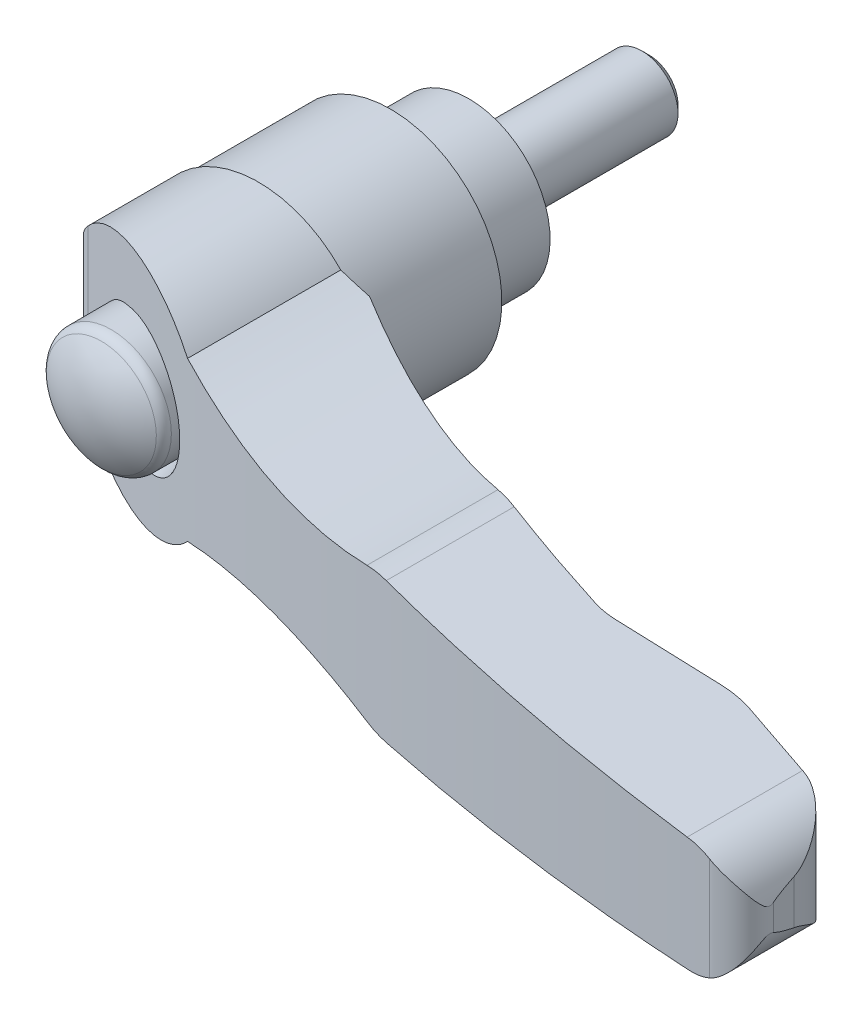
ISO-10303-21;
HEADER;
FILE_DESCRIPTION(('STEP AP214'),'2;1');
FILE_NAME('part.step','',(''),(''),'','','');
FILE_SCHEMA(('AUTOMOTIVE_DESIGN { 1 0 10303 214 1 1 1 1 }'));
ENDSEC;
DATA;
#1=APPLICATION_CONTEXT('core data for automotive mechanical design processes');
#2=APPLICATION_PROTOCOL_DEFINITION('international standard','automotive_design',2000,#1);
#3=PRODUCT_CONTEXT('',#1,'mechanical');
#4=PRODUCT('Part','Part','',(#3));
#5=PRODUCT_RELATED_PRODUCT_CATEGORY('part','',(#4));
#6=PRODUCT_DEFINITION_FORMATION('','',#4);
#7=PRODUCT_DEFINITION_CONTEXT('part definition',#1,'design');
#8=PRODUCT_DEFINITION('design','',#6,#7);
#9=PRODUCT_DEFINITION_SHAPE('','',#8);
#10=(LENGTH_UNIT() NAMED_UNIT(*) SI_UNIT(.MILLI.,.METRE.));
#11=(NAMED_UNIT(*) PLANE_ANGLE_UNIT() SI_UNIT($,.RADIAN.));
#12=(NAMED_UNIT(*) SI_UNIT($,.STERADIAN.) SOLID_ANGLE_UNIT());
#13=UNCERTAINTY_MEASURE_WITH_UNIT(LENGTH_MEASURE(1.E-05),#10,'distance_accuracy_value','');
#14=(GEOMETRIC_REPRESENTATION_CONTEXT(3) GLOBAL_UNCERTAINTY_ASSIGNED_CONTEXT((#13)) GLOBAL_UNIT_ASSIGNED_CONTEXT((#10,
#11,#12)) REPRESENTATION_CONTEXT('',''));
#15=CARTESIAN_POINT('',(0.,0.,0.));
#16=DIRECTION('',(0.,0.,1.));
#17=DIRECTION('',(1.,0.,0.));
#18=AXIS2_PLACEMENT_3D('',#15,#16,#17);
#19=CARTESIAN_POINT('',(1.19325,0.,-15.));
#20=DIRECTION('',(0.,0.,-1.));
#21=DIRECTION('',(0.,1.,0.));
#22=AXIS2_PLACEMENT_3D('',#19,#20,#21);
#23=PLANE('',#22);
#24=CARTESIAN_POINT('',(0.,0.,-14.9999999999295));
#25=DIRECTION('',(0.,0.,1.));
#26=DIRECTION('',(0.,-1.,0.));
#27=AXIS2_PLACEMENT_3D('',#24,#25,#26);
#28=CIRCLE('',#27,2.38650000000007);
#29=CARTESIAN_POINT('',(0.,-2.38650000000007,-14.9999999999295));
#30=VERTEX_POINT('',#29);
#31=EDGE_CURVE('E17',#30,#30,#28,.T.);
#32=ORIENTED_EDGE('',*,*,#31,.F.);
#33=EDGE_LOOP('',(#32));
#34=FACE_BOUND('',#33,.T.);
#35=ADVANCED_FACE('F14',(#34),#23,.T.);
#36=CARTESIAN_POINT('',(0.,0.,-14.3864999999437));
#37=DIRECTION('',(0.,0.,1.));
#38=DIRECTION('',(0.,-1.,0.));
#39=AXIS2_PLACEMENT_3D('',#36,#37,#38);
#40=CONICAL_SURFACE('',#39,2.99999999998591,0.785398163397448);
#41=CARTESIAN_POINT('',(0.,0.,-14.3865));
#42=DIRECTION('',(0.,0.,-1.));
#43=DIRECTION('',(0.,1.,0.));
#44=AXIS2_PLACEMENT_3D('',#41,#42,#43);
#45=CIRCLE('',#44,3.);
#46=CARTESIAN_POINT('',(0.,3.,-14.3865));
#47=VERTEX_POINT('',#46);
#48=EDGE_CURVE('E196',#47,#47,#45,.F.);
#49=ORIENTED_EDGE('',*,*,#48,.F.);
#50=EDGE_LOOP('',(#49));
#51=FACE_BOUND('',#50,.T.);
#52=ORIENTED_EDGE('',*,*,#31,.T.);
#53=EDGE_LOOP('',(#52));
#54=FACE_BOUND('',#53,.T.);
#55=ADVANCED_FACE('F449',(#51,#54),#40,.T.);
#56=CARTESIAN_POINT('',(0.,0.,-7.19325));
#57=DIRECTION('',(0.,0.,-1.));
#58=DIRECTION('',(0.,1.,0.));
#59=AXIS2_PLACEMENT_3D('',#56,#57,#58);
#60=CYLINDRICAL_SURFACE('',#59,3.);
#61=CARTESIAN_POINT('',(0.,0.,0.));
#62=DIRECTION('',(0.,0.,-1.));
#63=DIRECTION('',(0.,1.,0.));
#64=AXIS2_PLACEMENT_3D('',#61,#62,#63);
#65=CIRCLE('',#64,3.);
#66=CARTESIAN_POINT('',(0.,3.,0.));
#67=VERTEX_POINT('',#66);
#68=EDGE_CURVE('E198',#67,#67,#65,.F.);
#69=ORIENTED_EDGE('',*,*,#68,.F.);
#70=EDGE_LOOP('',(#69));
#71=FACE_BOUND('',#70,.T.);
#72=ORIENTED_EDGE('',*,*,#48,.T.);
#73=EDGE_LOOP('',(#72));
#74=FACE_BOUND('',#73,.T.);
#75=ADVANCED_FACE('F446',(#71,#74),#60,.T.);
#76=CARTESIAN_POINT('',(4.875,0.,0.));
#77=DIRECTION('',(0.,0.,-1.));
#78=DIRECTION('',(0.,1.,0.));
#79=AXIS2_PLACEMENT_3D('',#76,#77,#78);
#80=PLANE('',#79);
#81=ORIENTED_EDGE('',*,*,#68,.T.);
#82=EDGE_LOOP('',(#81));
#83=FACE_BOUND('',#82,.T.);
#84=CARTESIAN_POINT('',(0.,0.,0.));
#85=DIRECTION('',(0.,0.,-1.));
#86=DIRECTION('',(0.,1.,0.));
#87=AXIS2_PLACEMENT_3D('',#84,#85,#86);
#88=CIRCLE('',#87,6.75);
#89=CARTESIAN_POINT('',(0.,6.75,0.));
#90=VERTEX_POINT('',#89);
#91=EDGE_CURVE('E195',#90,#90,#88,.F.);
#92=ORIENTED_EDGE('',*,*,#91,.F.);
#93=EDGE_LOOP('',(#92));
#94=FACE_BOUND('',#93,.T.);
#95=ADVANCED_FACE('F443',(#83,#94),#80,.T.);
#96=CARTESIAN_POINT('',(0.,0.,8.25));
#97=DIRECTION('',(0.,0.,-1.));
#98=DIRECTION('',(0.,1.,0.));
#99=AXIS2_PLACEMENT_3D('',#96,#97,#98);
#100=CYLINDRICAL_SURFACE('',#99,6.75);
#101=ORIENTED_EDGE('',*,*,#91,.T.);
#102=EDGE_LOOP('',(#101));
#103=FACE_BOUND('',#102,.T.);
#104=CARTESIAN_POINT('',(0.,0.,7.15000000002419));
#105=DIRECTION('',(0.,0.,-1.));
#106=DIRECTION('',(1.,0.,0.));
#107=AXIS2_PLACEMENT_3D('',#104,#105,#106);
#108=CIRCLE('',#107,6.74999999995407);
#109=CARTESIAN_POINT('',(6.74999999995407,0.,7.15000000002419));
#110=VERTEX_POINT('',#109);
#111=EDGE_CURVE('E192',#110,#110,#108,.T.);
#112=ORIENTED_EDGE('',*,*,#111,.T.);
#113=EDGE_LOOP('',(#112));
#114=FACE_BOUND('',#113,.T.);
#115=ADVANCED_FACE('F480',(#103,#114),#100,.T.);
#116=CARTESIAN_POINT('',(0.,0.,6.9000000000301));
#117=DIRECTION('',(0.,0.,-1.));
#118=DIRECTION('',(0.,1.,0.));
#119=AXIS2_PLACEMENT_3D('',#116,#117,#118);
#120=CONICAL_SURFACE('',#119,7.000000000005,0.785398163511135);
#121=ORIENTED_EDGE('',*,*,#111,.F.);
#122=EDGE_LOOP('',(#121));
#123=FACE_BOUND('',#122,.T.);
#124=CARTESIAN_POINT('',(0.,0.,6.9));
#125=DIRECTION('',(0.,0.,-1.));
#126=DIRECTION('',(0.,1.,0.));
#127=AXIS2_PLACEMENT_3D('',#124,#125,#126);
#128=CIRCLE('',#127,7.);
#129=CARTESIAN_POINT('',(0.,7.,6.9));
#130=VERTEX_POINT('',#129);
#131=EDGE_CURVE('E184',#130,#130,#128,.T.);
#132=ORIENTED_EDGE('',*,*,#131,.T.);
#133=EDGE_LOOP('',(#132));
#134=FACE_BOUND('',#133,.T.);
#135=ADVANCED_FACE('F488',(#123,#134),#120,.F.);
#136=CARTESIAN_POINT('',(0.,0.,6.2));
#137=DIRECTION('',(0.,0.,-1.));
#138=DIRECTION('',(0.,1.,0.));
#139=AXIS2_PLACEMENT_3D('',#136,#137,#138);
#140=CYLINDRICAL_SURFACE('',#139,7.);
#141=ORIENTED_EDGE('',*,*,#131,.F.);
#142=EDGE_LOOP('',(#141));
#143=FACE_BOUND('',#142,.T.);
#144=CARTESIAN_POINT('',(0.,0.,6.5));
#145=DIRECTION('',(0.,0.,-1.));
#146=DIRECTION('',(0.,1.,0.));
#147=AXIS2_PLACEMENT_3D('',#144,#145,#146);
#148=CIRCLE('',#147,7.);
#149=CARTESIAN_POINT('',(0.,7.,6.5));
#150=VERTEX_POINT('',#149);
#151=EDGE_CURVE('E181',#150,#150,#148,.F.);
#152=ORIENTED_EDGE('',*,*,#151,.F.);
#153=EDGE_LOOP('',(#152));
#154=FACE_BOUND('',#153,.T.);
#155=ADVANCED_FACE('F497',(#143,#154),#140,.F.);
#156=CARTESIAN_POINT('',(-9.01003775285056,-19.,6.5));
#157=DIRECTION('',(0.707106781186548,0.,0.707106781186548));
#158=DIRECTION('',(-0.707106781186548,0.,0.707106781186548));
#159=AXIS2_PLACEMENT_3D('',#156,#157,#158);
#160=PLANE('',#159);
#161=DIRECTION('',(0.,1.,0.));
#162=VECTOR('',#161,1.);
#163=CARTESIAN_POINT('',(-9.01003775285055,0.,6.5));
#164=LINE('',#163,#162);
#165=CARTESIAN_POINT('',(-9.01003775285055,-2.13584185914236,6.5));
#166=VERTEX_POINT('',#165);
#167=CARTESIAN_POINT('',(-9.01003775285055,2.13584185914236,6.5));
#168=VERTEX_POINT('',#167);
#169=EDGE_CURVE('E165',#166,#168,#164,.T.);
#170=ORIENTED_EDGE('',*,*,#169,.F.);
#171=CARTESIAN_POINT('',(-0.00999999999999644,0.,-2.50003775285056));
#172=DIRECTION('',(0.707106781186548,0.,0.707106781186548));
#173=DIRECTION('',(-0.707106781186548,0.,0.707106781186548));
#174=AXIS2_PLACEMENT_3D('',#171,#172,#173);
#175=ELLIPSE('',#174,13.0814754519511,9.25);
#176=EDGE_CURVE('E168',#168,#166,#175,.T.);
#177=ORIENTED_EDGE('',*,*,#176,.F.);
#178=EDGE_LOOP('',(#170,#177));
#179=FACE_BOUND('',#178,.T.);
#180=ADVANCED_FACE('F170',(#179),#160,.F.);
#181=CARTESIAN_POINT('',(-4.635,0.,6.5));
#182=DIRECTION('',(0.,0.,-1.));
#183=DIRECTION('',(0.,1.,0.));
#184=AXIS2_PLACEMENT_3D('',#181,#182,#183);
#185=PLANE('',#184);
#186=ORIENTED_EDGE('',*,*,#169,.T.);
#187=CARTESIAN_POINT('',(-0.00999999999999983,0.,6.5));
#188=DIRECTION('',(0.,0.,1.));
#189=DIRECTION('',(-1.,0.,0.));
#190=AXIS2_PLACEMENT_3D('',#187,#188,#189);
#191=CIRCLE('',#190,9.25);
#192=EDGE_CURVE('E172',#166,#168,#191,.T.);
#193=ORIENTED_EDGE('',*,*,#192,.F.);
#194=EDGE_LOOP('',(#186,#193));
#195=FACE_BOUND('',#194,.T.);
#196=ORIENTED_EDGE('',*,*,#151,.T.);
#197=EDGE_LOOP('',(#196));
#198=FACE_BOUND('',#197,.T.);
#199=ADVANCED_FACE('F179',(#195,#198),#185,.T.);
#200=CARTESIAN_POINT('',(-0.0100000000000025,0.,13.5625));
#201=DIRECTION('',(0.,0.,1.));
#202=DIRECTION('',(-1.,0.,0.));
#203=AXIS2_PLACEMENT_3D('',#200,#201,#202);
#204=CYLINDRICAL_SURFACE('',#203,9.25);
#205=ORIENTED_EDGE('',*,*,#192,.T.);
#206=ORIENTED_EDGE('',*,*,#176,.T.);
#207=EDGE_LOOP('',(#205,#206));
#208=FACE_BOUND('',#207,.T.);
#209=CARTESIAN_POINT('',(-0.010000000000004,0.,17.5));
#210=DIRECTION('',(0.,0.,1.));
#211=DIRECTION('',(-1.,0.,0.));
#212=AXIS2_PLACEMENT_3D('',#209,#210,#211);
#213=CIRCLE('',#212,9.25);
#214=CARTESIAN_POINT('',(-9.26,0.,17.5));
#215=VERTEX_POINT('',#214);
#216=CARTESIAN_POINT('',(9.23999999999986,0.,17.5000000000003));
#217=VERTEX_POINT('',#216);
#218=EDGE_CURVE('E420',#215,#217,#213,.T.);
#219=ORIENTED_EDGE('',*,*,#218,.F.);
#220=CARTESIAN_POINT('',(-0.010000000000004,0.,17.5));
#221=DIRECTION('',(0.,0.,1.));
#222=DIRECTION('',(-1.,0.,0.));
#223=AXIS2_PLACEMENT_3D('',#220,#221,#222);
#224=CIRCLE('',#223,9.25);
#225=EDGE_CURVE('E429',#217,#215,#224,.T.);
#226=ORIENTED_EDGE('',*,*,#225,.F.);
#227=EDGE_LOOP('',(#219,#226));
#228=FACE_BOUND('',#227,.T.);
#229=ADVANCED_FACE('F174',(#208,#228),#204,.T.);
#230=CARTESIAN_POINT('',(0.,0.,24.));
#231=DIRECTION('',(1.,0.,0.));
#232=DIRECTION('',(0.,0.,1.));
#233=AXIS2_PLACEMENT_3D('',#230,#231,#232);
#234=SPHERICAL_SURFACE('',#233,8.);
#235=CARTESIAN_POINT('',(0.,0.,30.5652144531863));
#236=DIRECTION('',(0.,0.,1.));
#237=DIRECTION('',(0.,-1.,0.));
#238=AXIS2_PLACEMENT_3D('',#235,#236,#237);
#239=CIRCLE('',#238,4.57142857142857);
#240=CARTESIAN_POINT('',(0.,-4.57142857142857,30.5652144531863));
#241=VERTEX_POINT('',#240);
#242=EDGE_CURVE('E404',#241,#241,#239,.F.);
#243=ORIENTED_EDGE('',*,*,#242,.F.);
#244=EDGE_LOOP('',(#243));
#245=FACE_BOUND('',#244,.T.);
#246=ADVANCED_FACE('F528',(#245),#234,.T.);
#247=CARTESIAN_POINT('',(64.6274051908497,-10.5,37.5817950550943));
#248=DIRECTION('',(0.992331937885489,0.,-0.123601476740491));
#249=DIRECTION('',(0.123601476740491,0.,0.992331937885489));
#250=AXIS2_PLACEMENT_3D('',#247,#248,#249);
#251=PLANE('',#250);
#252=CARTESIAN_POINT('',(60.25,0.,2.43788666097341));
#253=DIRECTION('',(0.992331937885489,0.,-0.123601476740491));
#254=DIRECTION('',(0.123601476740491,0.,0.992331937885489));
#255=AXIS2_PLACEMENT_3D('',#252,#253,#254);
#256=ELLIPSE('',#255,38.4299615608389,4.75);
#257=CARTESIAN_POINT('',(64.8745408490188,1.08449155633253,39.5659186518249));
#258=VERTEX_POINT('',#257);
#259=CARTESIAN_POINT('',(64.6274051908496,1.84413226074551,37.5817950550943));
#260=VERTEX_POINT('',#259);
#261=EDGE_CURVE('E838',#258,#260,#256,.F.);
#262=ORIENTED_EDGE('',*,*,#261,.F.);
#263=DIRECTION('',(0.,-1.,0.));
#264=VECTOR('',#263,1.);
#265=CARTESIAN_POINT('',(64.8745408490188,-10.5,39.5659186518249));
#266=LINE('',#265,#264);
#267=CARTESIAN_POINT('',(64.8745408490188,-1.08449155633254,39.5659186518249));
#268=VERTEX_POINT('',#267);
#269=EDGE_CURVE('E793',#268,#258,#266,.F.);
#270=ORIENTED_EDGE('',*,*,#269,.F.);
#271=CARTESIAN_POINT('',(60.25,0.,2.43788666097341));
#272=DIRECTION('',(0.992331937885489,0.,-0.123601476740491));
#273=DIRECTION('',(0.123601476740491,0.,0.992331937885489));
#274=AXIS2_PLACEMENT_3D('',#271,#272,#273);
#275=ELLIPSE('',#274,38.4299615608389,4.75);
#276=CARTESIAN_POINT('',(64.6274051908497,-1.84413226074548,37.5817950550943));
#277=VERTEX_POINT('',#276);
#278=EDGE_CURVE('E801',#277,#268,#275,.F.);
#279=ORIENTED_EDGE('',*,*,#278,.F.);
#280=DIRECTION('',(0.,-1.,0.));
#281=VECTOR('',#280,1.);
#282=CARTESIAN_POINT('',(64.6274051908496,-10.5,37.5817950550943));
#283=LINE('',#282,#281);
#284=EDGE_CURVE('E177',#260,#277,#283,.T.);
#285=ORIENTED_EDGE('',*,*,#284,.F.);
#286=EDGE_LOOP('',(#262,#270,#279,#285));
#287=FACE_BOUND('',#286,.T.);
#288=ADVANCED_FACE('F536',(#287),#251,.T.);
#289=CARTESIAN_POINT('',(58.6337202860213,-10.5,38.3283479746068));
#290=DIRECTION('',(0.,-1.,0.));
#291=DIRECTION('',(1.,0.,0.));
#292=AXIS2_PLACEMENT_3D('',#289,#290,#291);
#293=CYLINDRICAL_SURFACE('',#292,6.04);
#294=CARTESIAN_POINT('',(64.6274051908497,1.84413226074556,37.5817950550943));
#295=CARTESIAN_POINT('',(64.6175868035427,1.86745330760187,37.5030045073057));
#296=CARTESIAN_POINT('',(64.6063375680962,1.89362327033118,37.4253204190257));
#297=CARTESIAN_POINT('',(64.5811702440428,1.95049016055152,37.2721928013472));
#298=CARTESIAN_POINT('',(64.5672561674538,1.98118026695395,37.1967460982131));
#299=CARTESIAN_POINT('',(64.5369883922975,2.04585034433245,37.0482136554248));
#300=CARTESIAN_POINT('',(64.520645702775,2.07981523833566,36.9751189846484));
#301=CARTESIAN_POINT('',(64.4855821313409,2.15032519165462,36.8307396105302));
#302=CARTESIAN_POINT('',(64.4668602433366,2.18687133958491,36.7594556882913));
#303=CARTESIAN_POINT('',(64.4072221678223,2.29938724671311,36.547961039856));
#304=CARTESIAN_POINT('',(64.3628565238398,2.37818379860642,36.410218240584));
#305=CARTESIAN_POINT('',(64.2652007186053,2.53960895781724,36.1400450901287));
#306=CARTESIAN_POINT('',(64.2118976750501,2.6222429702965,36.007622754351));
#307=CARTESIAN_POINT('',(64.077119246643,2.81672317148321,35.7040219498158));
#308=CARTESIAN_POINT('',(63.9921849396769,2.92909268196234,35.5347005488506));
#309=CARTESIAN_POINT('',(63.8063278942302,3.15216626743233,35.2039790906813));
#310=CARTESIAN_POINT('',(63.7054078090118,3.26287061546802,35.0425777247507));
#311=CARTESIAN_POINT('',(63.4870671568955,3.47959027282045,34.7278934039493));
#312=CARTESIAN_POINT('',(63.369645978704,3.58560540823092,34.5746107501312));
#313=CARTESIAN_POINT('',(63.1179209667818,3.78996521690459,34.277236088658));
#314=CARTESIAN_POINT('',(62.9836257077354,3.88831374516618,34.1331394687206));
#315=CARTESIAN_POINT('',(62.6561598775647,4.10136712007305,33.815313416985));
#316=CARTESIAN_POINT('',(62.4571888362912,4.21258905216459,33.6450495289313));
#317=CARTESIAN_POINT('',(62.1378586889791,4.36029911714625,33.4069452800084));
#318=CARTESIAN_POINT('',(62.0281124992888,4.40629516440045,33.3305585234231));
#319=CARTESIAN_POINT('',(61.8018114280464,4.49098569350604,33.1841350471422));
#320=CARTESIAN_POINT('',(61.6852609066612,4.52968478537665,33.1140943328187));
#321=CARTESIAN_POINT('',(61.4786111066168,4.58924867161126,32.9993621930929));
#322=CARTESIAN_POINT('',(61.3900115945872,4.61209493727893,32.9529824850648));
#323=CARTESIAN_POINT('',(61.2097340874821,4.65295056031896,32.8642982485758));
#324=CARTESIAN_POINT('',(61.1180570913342,4.67096147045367,32.82199241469));
#325=CARTESIAN_POINT('',(60.9313596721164,4.70183469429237,32.7415027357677));
#326=CARTESIAN_POINT('',(60.8363219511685,4.71466416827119,32.7033462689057));
#327=CARTESIAN_POINT('',(60.6438287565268,4.73463763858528,32.631712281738));
#328=CARTESIAN_POINT('',(60.5463713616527,4.74177695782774,32.5982386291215));
#329=CARTESIAN_POINT('',(60.4479724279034,4.74587261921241,32.5672639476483));
#330=B_SPLINE_CURVE_WITH_KNOTS('',3,(#294,#295,#296,#297,#298,#299,#300,#301,#302,#303,#304,
#305,#306,#307,#308,#309,#310,#311,#312,#313,#314,#315,#316,#317,#318,#319,#320,#321,#322,#323,
#324,#325,#326,#327,#328,#329),.UNSPECIFIED.,.F.,.F.,(4,2,2,2,2,2,2,2,2,2,2,2,2,2,2,2,2,4),(0.,
0.248076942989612,0.495783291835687,0.742399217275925,0.989119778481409,1.48293160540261,
1.97746142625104,2.63745339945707,3.29733594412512,3.95724294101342,4.61681594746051,
5.46693586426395,5.89075482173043,6.31430511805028,6.62183365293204,6.92926331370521,
7.23861197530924,7.54821464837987),.UNSPECIFIED.);
#331=CARTESIAN_POINT('',(60.4479724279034,4.74587261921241,32.5672639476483));
#332=VERTEX_POINT('',#331);
#333=EDGE_CURVE('E792',#260,#332,#330,.T.);
#334=ORIENTED_EDGE('',*,*,#333,.F.);
#335=ORIENTED_EDGE('',*,*,#284,.T.);
#336=CARTESIAN_POINT('',(60.4479724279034,-4.74587261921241,32.5672639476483));
#337=CARTESIAN_POINT('',(60.5755504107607,-4.74057354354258,32.6074069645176));
#338=CARTESIAN_POINT('',(60.7015088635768,-4.73014540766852,32.6517620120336));
#339=CARTESIAN_POINT('',(60.9490652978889,-4.69992242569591,32.7481786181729));
#340=CARTESIAN_POINT('',(61.0706698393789,-4.6801423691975,32.8002279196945));
#341=CARTESIAN_POINT('',(61.3074659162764,-4.63235500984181,32.9108206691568));
#342=CARTESIAN_POINT('',(61.4227141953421,-4.60444273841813,32.9692844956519));
#343=CARTESIAN_POINT('',(61.6477173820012,-4.54120548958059,33.0925213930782));
#344=CARTESIAN_POINT('',(61.7574696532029,-4.50587699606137,33.1572974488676));
#345=CARTESIAN_POINT('',(61.9940137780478,-4.42040174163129,33.307032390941));
#346=CARTESIAN_POINT('',(62.1193938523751,-4.36870213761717,33.3933358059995));
#347=CARTESIAN_POINT('',(62.3610721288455,-4.25718277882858,33.5732278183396));
#348=CARTESIAN_POINT('',(62.4773638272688,-4.19735729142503,33.6668215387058));
#349=CARTESIAN_POINT('',(62.7012840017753,-4.07066877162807,33.8608437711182));
#350=CARTESIAN_POINT('',(62.8088611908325,-4.0037687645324,33.9613071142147));
#351=CARTESIAN_POINT('',(63.0146476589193,-3.86453813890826,34.1677809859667));
#352=CARTESIAN_POINT('',(63.1128596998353,-3.79220913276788,34.2737898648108));
#353=CARTESIAN_POINT('',(63.3331746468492,-3.61700510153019,34.5290929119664));
#354=CARTESIAN_POINT('',(63.4514763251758,-3.51235864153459,34.6804594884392));
#355=CARTESIAN_POINT('',(63.6718053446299,-3.29808480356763,34.9913387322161));
#356=CARTESIAN_POINT('',(63.7738256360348,-3.18845529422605,35.1508548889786));
#357=CARTESIAN_POINT('',(63.961662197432,-2.9676568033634,35.4770445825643));
#358=CARTESIAN_POINT('',(64.0475378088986,-2.85649513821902,35.6436890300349));
#359=CARTESIAN_POINT('',(64.2038484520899,-2.63586419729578,35.9851508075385));
#360=CARTESIAN_POINT('',(64.2742871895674,-2.52639452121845,36.1599661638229));
#361=CARTESIAN_POINT('',(64.3705847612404,-2.36382517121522,36.4361542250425));
#362=CARTESIAN_POINT('',(64.4019853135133,-2.30809068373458,36.5340606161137));
#363=CARTESIAN_POINT('',(64.4601539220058,-2.20019362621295,36.7330390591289));
#364=CARTESIAN_POINT('',(64.4869269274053,-2.14802727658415,36.8341075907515));
#365=CARTESIAN_POINT('',(64.5357331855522,-2.04890785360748,37.0402846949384));
#366=CARTESIAN_POINT('',(64.5577546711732,-2.00196785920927,37.1454025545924));
#367=CARTESIAN_POINT('',(64.596614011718,-1.91618262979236,37.360168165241));
#368=CARTESIAN_POINT('',(64.6134353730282,-1.87736327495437,37.4698291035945));
#369=CARTESIAN_POINT('',(64.6274051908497,-1.84413226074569,37.5817950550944));
#370=B_SPLINE_CURVE_WITH_KNOTS('',3,(#336,#337,#338,#339,#340,#341,#342,#343,#344,#345,#346,
#347,#348,#349,#350,#351,#352,#353,#354,#355,#356,#357,#358,#359,#360,#361,#362,#363,#364,#365,
#366,#367,#368,#369),.UNSPECIFIED.,.F.,.F.,(4,2,2,2,2,2,2,2,2,2,2,2,2,2,2,2,4),(0.,
0.401264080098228,0.801895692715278,1.19802151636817,1.59433557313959,2.0758833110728,
2.55777255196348,3.04231807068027,3.52672024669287,4.18208013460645,4.83772302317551,
5.49090678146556,6.1439335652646,6.49464389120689,6.84497677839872,7.19616755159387,
7.54846105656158),.UNSPECIFIED.);
#371=CARTESIAN_POINT('',(60.4479724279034,-4.74587261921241,32.5672639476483));
#372=VERTEX_POINT('',#371);
#373=EDGE_CURVE('E804',#372,#277,#370,.T.);
#374=ORIENTED_EDGE('',*,*,#373,.F.);
#375=DIRECTION('',(0.,-1.,0.));
#376=VECTOR('',#375,1.);
#377=CARTESIAN_POINT('',(60.4479724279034,-10.5,32.5672639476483));
#378=LINE('',#377,#376);
#379=EDGE_CURVE('E418',#332,#372,#378,.T.);
#380=ORIENTED_EDGE('',*,*,#379,.F.);
#381=EDGE_LOOP('',(#334,#335,#374,#380));
#382=FACE_BOUND('',#381,.T.);
#383=ADVANCED_FACE('F545',(#382),#293,.T.);
#384=CARTESIAN_POINT('',(-9.26,-10.5,17.5));
#385=DIRECTION('',(0.,0.,-1.));
#386=DIRECTION('',(0.,1.,0.));
#387=AXIS2_PLACEMENT_3D('',#384,#385,#386);
#388=PLANE('',#387);
#389=DIRECTION('',(0.,-1.,0.));
#390=VECTOR('',#389,1.);
#391=CARTESIAN_POINT('',(-9.26,-10.5,17.5));
#392=LINE('',#391,#390);
#393=CARTESIAN_POINT('',(-9.26,2.12188595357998,17.5));
#394=VERTEX_POINT('',#393);
#395=EDGE_CURVE('E427',#394,#215,#392,.T.);
#396=ORIENTED_EDGE('',*,*,#395,.F.);
#397=CARTESIAN_POINT('',(0.,0.,17.5));
#398=DIRECTION('',(0.,0.,1.));
#399=DIRECTION('',(0.,-1.,0.));
#400=AXIS2_PLACEMENT_3D('',#397,#398,#399);
#401=CIRCLE('',#400,9.5);
#402=CARTESIAN_POINT('',(6.84374087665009,6.58887022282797,17.5));
#403=VERTEX_POINT('',#402);
#404=EDGE_CURVE('E341',#403,#394,#401,.T.);
#405=ORIENTED_EDGE('',*,*,#404,.F.);
#406=CARTESIAN_POINT('',(19.25,44.09,17.5));
#407=DIRECTION('',(0.,0.,1.));
#408=DIRECTION('',(0.,-1.,0.));
#409=AXIS2_PLACEMENT_3D('',#406,#407,#408);
#410=CIRCLE('',#409,39.5);
#411=CARTESIAN_POINT('',(9.23999999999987,5.8794006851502,17.5000000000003));
#412=VERTEX_POINT('',#411);
#413=EDGE_CURVE('E301',#403,#412,#410,.T.);
#414=ORIENTED_EDGE('',*,*,#413,.T.);
#415=DIRECTION('',(0.,-1.,0.));
#416=VECTOR('',#415,1.);
#417=CARTESIAN_POINT('',(9.23999999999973,-10.5,17.5000000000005));
#418=LINE('',#417,#416);
#419=EDGE_CURVE('E407',#412,#217,#418,.T.);
#420=ORIENTED_EDGE('',*,*,#419,.T.);
#421=ORIENTED_EDGE('',*,*,#225,.T.);
#422=EDGE_LOOP('',(#396,#405,#414,#420,#421));
#423=FACE_BOUND('',#422,.T.);
#424=ADVANCED_FACE('F554',(#423),#388,.T.);
#425=CARTESIAN_POINT('',(-9.26,-10.5,21.2038249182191));
#426=DIRECTION('',(-1.,0.,0.));
#427=DIRECTION('',(0.,-1.,0.));
#428=AXIS2_PLACEMENT_3D('',#425,#426,#427);
#429=PLANE('',#428);
#430=ORIENTED_EDGE('',*,*,#395,.T.);
#431=DIRECTION('',(0.,1.,0.));
#432=VECTOR('',#431,1.);
#433=CARTESIAN_POINT('',(-9.26,-10.5,17.5));
#434=LINE('',#433,#432);
#435=CARTESIAN_POINT('',(-9.26,-2.12188595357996,17.5));
#436=VERTEX_POINT('',#435);
#437=EDGE_CURVE('E421',#436,#215,#434,.T.);
#438=ORIENTED_EDGE('',*,*,#437,.F.);
#439=DIRECTION('',(0.,0.,1.));
#440=VECTOR('',#439,1.);
#441=CARTESIAN_POINT('',(-9.26,-2.12188595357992,42.5));
#442=LINE('',#441,#440);
#443=CARTESIAN_POINT('',(-9.26,-2.12188595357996,21.2038249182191));
#444=VERTEX_POINT('',#443);
#445=EDGE_CURVE('E424',#444,#436,#442,.F.);
#446=ORIENTED_EDGE('',*,*,#445,.F.);
#447=DIRECTION('',(0.,-1.,0.));
#448=VECTOR('',#447,1.);
#449=CARTESIAN_POINT('',(-9.26,-10.5,21.2038249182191));
#450=LINE('',#449,#448);
#451=CARTESIAN_POINT('',(-9.26,2.12188595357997,21.2038249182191));
#452=VERTEX_POINT('',#451);
#453=EDGE_CURVE('E765',#452,#444,#450,.T.);
#454=ORIENTED_EDGE('',*,*,#453,.F.);
#455=DIRECTION('',(0.,0.,1.));
#456=VECTOR('',#455,1.);
#457=CARTESIAN_POINT('',(-9.26,2.12188595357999,42.5));
#458=LINE('',#457,#456);
#459=EDGE_CURVE('E344',#394,#452,#458,.T.);
#460=ORIENTED_EDGE('',*,*,#459,.F.);
#461=EDGE_LOOP('',(#430,#438,#446,#454,#460));
#462=FACE_BOUND('',#461,.T.);
#463=ADVANCED_FACE('F562',(#462),#429,.T.);
#464=CARTESIAN_POINT('',(-9.26,-10.5,17.5));
#465=DIRECTION('',(0.,0.,-1.));
#466=DIRECTION('',(0.,1.,0.));
#467=AXIS2_PLACEMENT_3D('',#464,#465,#466);
#468=PLANE('',#467);
#469=DIRECTION('',(0.,-1.,0.));
#470=VECTOR('',#469,1.);
#471=CARTESIAN_POINT('',(9.23999999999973,-10.5,17.5000000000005));
#472=LINE('',#471,#470);
#473=CARTESIAN_POINT('',(9.23999999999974,-5.87940068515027,17.5000000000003));
#474=VERTEX_POINT('',#473);
#475=EDGE_CURVE('E405',#217,#474,#472,.T.);
#476=ORIENTED_EDGE('',*,*,#475,.T.);
#477=CARTESIAN_POINT('',(19.25,-44.09,17.5));
#478=DIRECTION('',(0.,0.,1.));
#479=DIRECTION('',(0.,-1.,0.));
#480=AXIS2_PLACEMENT_3D('',#477,#478,#479);
#481=CIRCLE('',#480,39.5);
#482=CARTESIAN_POINT('',(6.84374087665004,-6.588870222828,17.5));
#483=VERTEX_POINT('',#482);
#484=EDGE_CURVE('E881',#474,#483,#481,.T.);
#485=ORIENTED_EDGE('',*,*,#484,.T.);
#486=CARTESIAN_POINT('',(0.,0.,17.5));
#487=DIRECTION('',(0.,0.,1.));
#488=DIRECTION('',(0.,-1.,0.));
#489=AXIS2_PLACEMENT_3D('',#486,#487,#488);
#490=CIRCLE('',#489,9.5);
#491=EDGE_CURVE('E770',#436,#483,#490,.T.);
#492=ORIENTED_EDGE('',*,*,#491,.F.);
#493=ORIENTED_EDGE('',*,*,#437,.T.);
#494=ORIENTED_EDGE('',*,*,#218,.T.);
#495=EDGE_LOOP('',(#476,#485,#492,#493,#494));
#496=FACE_BOUND('',#495,.T.);
#497=ADVANCED_FACE('F570',(#496),#468,.T.);
#498=CARTESIAN_POINT('',(53.8294507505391,-10.5,30.4829917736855));
#499=DIRECTION('',(0.300372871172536,0.,-0.95382185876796));
#500=DIRECTION('',(0.95382185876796,0.,0.300372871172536));
#501=AXIS2_PLACEMENT_3D('',#498,#499,#500);
#502=PLANE('',#501);
#503=CARTESIAN_POINT('',(60.25,0.,32.5049194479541));
#504=DIRECTION('',(0.300372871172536,0.,-0.95382185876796));
#505=DIRECTION('',(0.95382185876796,0.,0.300372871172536));
#506=AXIS2_PLACEMENT_3D('',#503,#504,#505);
#507=ELLIPSE('',#506,4.97996555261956,4.75);
#508=CARTESIAN_POINT('',(60.25,4.75,32.5049194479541));
#509=VERTEX_POINT('',#508);
#510=EDGE_CURVE('E794',#332,#509,#507,.F.);
#511=ORIENTED_EDGE('',*,*,#510,.F.);
#512=ORIENTED_EDGE('',*,*,#379,.T.);
#513=CARTESIAN_POINT('',(60.25,0.,32.5049194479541));
#514=DIRECTION('',(0.300372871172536,0.,-0.95382185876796));
#515=DIRECTION('',(0.95382185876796,0.,0.300372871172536));
#516=AXIS2_PLACEMENT_3D('',#513,#514,#515);
#517=ELLIPSE('',#516,4.97996555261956,4.75);
#518=CARTESIAN_POINT('',(60.25,-4.75,32.5049194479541));
#519=VERTEX_POINT('',#518);
#520=EDGE_CURVE('E827',#519,#372,#517,.F.);
#521=ORIENTED_EDGE('',*,*,#520,.F.);
#522=DIRECTION('',(-0.953255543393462,-0.0344545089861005,-0.300194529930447));
#523=VECTOR('',#522,1.);
#524=CARTESIAN_POINT('',(60.25,-4.75,32.5049194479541));
#525=LINE('',#524,#523);
#526=CARTESIAN_POINT('',(53.8294507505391,-4.98206460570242,30.4829917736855));
#527=VERTEX_POINT('',#526);
#528=EDGE_CURVE('E873',#519,#527,#525,.T.);
#529=ORIENTED_EDGE('',*,*,#528,.T.);
#530=DIRECTION('',(0.,-1.,0.));
#531=VECTOR('',#530,1.);
#532=CARTESIAN_POINT('',(53.8294507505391,-10.5,30.4829917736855));
#533=LINE('',#532,#531);
#534=CARTESIAN_POINT('',(53.8294507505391,4.98206460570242,30.4829917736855));
#535=VERTEX_POINT('',#534);
#536=EDGE_CURVE('E415',#535,#527,#533,.T.);
#537=ORIENTED_EDGE('',*,*,#536,.F.);
#538=DIRECTION('',(0.953255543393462,-0.0344545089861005,0.300194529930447));
#539=VECTOR('',#538,1.);
#540=CARTESIAN_POINT('',(53.8294507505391,4.98206460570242,30.4829917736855));
#541=LINE('',#540,#539);
#542=EDGE_CURVE('E300',#535,#509,#541,.T.);
#543=ORIENTED_EDGE('',*,*,#542,.T.);
#544=EDGE_LOOP('',(#511,#512,#521,#529,#537,#543));
#545=FACE_BOUND('',#544,.T.);
#546=ADVANCED_FACE('F579',(#545),#502,.T.);
#547=CARTESIAN_POINT('',(51.0780352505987,-10.5,39.22));
#548=DIRECTION('',(0.,-1.,0.));
#549=DIRECTION('',(1.,0.,0.));
#550=AXIS2_PLACEMENT_3D('',#547,#548,#549);
#551=CYLINDRICAL_SURFACE('',#550,9.15999999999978);
#552=CARTESIAN_POINT('',(51.0780352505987,5.08151188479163,39.22));
#553=DIRECTION('',(-0.0361204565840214,-0.999347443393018,0.));
#554=DIRECTION('',(0.999347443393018,-0.0361204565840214,0.));
#555=AXIS2_PLACEMENT_3D('',#552,#553,#554);
#556=ELLIPSE('',#555,9.16598132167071,9.15999999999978);
#557=CARTESIAN_POINT('',(51.0780352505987,5.08151188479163,30.06));
#558=VERTEX_POINT('',#557);
#559=EDGE_CURVE('E303',#558,#535,#556,.T.);
#560=ORIENTED_EDGE('',*,*,#559,.T.);
#561=ORIENTED_EDGE('',*,*,#536,.T.);
#562=CARTESIAN_POINT('',(51.0780352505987,-5.08151188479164,39.22));
#563=DIRECTION('',(-0.0361204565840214,0.999347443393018,0.));
#564=DIRECTION('',(-0.999347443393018,-0.0361204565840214,0.));
#565=AXIS2_PLACEMENT_3D('',#562,#563,#564);
#566=ELLIPSE('',#565,9.16598132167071,9.15999999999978);
#567=CARTESIAN_POINT('',(51.0780352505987,-5.08151188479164,30.06));
#568=VERTEX_POINT('',#567);
#569=EDGE_CURVE('E872',#527,#568,#566,.T.);
#570=ORIENTED_EDGE('',*,*,#569,.T.);
#571=DIRECTION('',(0.,1.,0.));
#572=VECTOR('',#571,1.);
#573=CARTESIAN_POINT('',(51.0780352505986,-10.5,30.06));
#574=LINE('',#573,#572);
#575=EDGE_CURVE('E412',#558,#568,#574,.F.);
#576=ORIENTED_EDGE('',*,*,#575,.F.);
#577=EDGE_LOOP('',(#560,#561,#570,#576));
#578=FACE_BOUND('',#577,.T.);
#579=ADVANCED_FACE('F588',(#578),#551,.T.);
#580=CARTESIAN_POINT('',(42.239481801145,-10.5,30.06));
#581=DIRECTION('',(0.,0.,-1.));
#582=DIRECTION('',(0.,1.,0.));
#583=AXIS2_PLACEMENT_3D('',#580,#581,#582);
#584=PLANE('',#583);
#585=DIRECTION('',(0.999347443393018,-0.0361204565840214,0.));
#586=VECTOR('',#585,1.);
#587=CARTESIAN_POINT('',(30.3472861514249,5.83080496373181,30.06));
#588=LINE('',#587,#586);
#589=CARTESIAN_POINT('',(42.239481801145,5.4009729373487,30.06));
#590=VERTEX_POINT('',#589);
#591=EDGE_CURVE('E786',#590,#558,#588,.T.);
#592=ORIENTED_EDGE('',*,*,#591,.T.);
#593=ORIENTED_EDGE('',*,*,#575,.T.);
#594=DIRECTION('',(-0.999347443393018,-0.0361204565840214,0.));
#595=VECTOR('',#594,1.);
#596=CARTESIAN_POINT('',(60.25,-4.75,30.06));
#597=LINE('',#596,#595);
#598=CARTESIAN_POINT('',(42.239481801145,-5.4009729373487,30.06));
#599=VERTEX_POINT('',#598);
#600=EDGE_CURVE('E869',#568,#599,#597,.T.);
#601=ORIENTED_EDGE('',*,*,#600,.T.);
#602=DIRECTION('',(0.,-1.,0.));
#603=VECTOR('',#602,1.);
#604=CARTESIAN_POINT('',(42.239481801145,-10.5,30.06));
#605=LINE('',#604,#603);
#606=EDGE_CURVE('E410',#599,#590,#605,.F.);
#607=ORIENTED_EDGE('',*,*,#606,.T.);
#608=EDGE_LOOP('',(#592,#593,#601,#607));
#609=FACE_BOUND('',#608,.T.);
#610=ADVANCED_FACE('F597',(#609),#584,.T.);
#611=CARTESIAN_POINT('',(42.2394818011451,-10.5,23.0799999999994));
#612=DIRECTION('',(0.,-1.,0.));
#613=DIRECTION('',(1.,0.,0.));
#614=AXIS2_PLACEMENT_3D('',#611,#612,#613);
#615=CYLINDRICAL_SURFACE('',#614,6.98000000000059);
#616=DIRECTION('',(0.,-1.,0.));
#617=VECTOR('',#616,1.);
#618=CARTESIAN_POINT('',(40.3024609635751,-10.5,29.785844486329));
#619=LINE('',#618,#617);
#620=CARTESIAN_POINT('',(40.3024609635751,-5.47098470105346,29.7858444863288));
#621=VERTEX_POINT('',#620);
#622=CARTESIAN_POINT('',(40.3024609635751,5.47098470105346,29.7858444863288));
#623=VERTEX_POINT('',#622);
#624=EDGE_CURVE('E402',#621,#623,#619,.F.);
#625=ORIENTED_EDGE('',*,*,#624,.T.);
#626=CARTESIAN_POINT('',(42.2394818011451,5.40097293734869,23.0799999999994));
#627=DIRECTION('',(-0.0361204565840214,-0.999347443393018,0.));
#628=DIRECTION('',(0.999347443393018,-0.0361204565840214,0.));
#629=AXIS2_PLACEMENT_3D('',#626,#627,#628);
#630=ELLIPSE('',#629,6.98455781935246,6.98000000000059);
#631=EDGE_CURVE('E789',#623,#590,#630,.F.);
#632=ORIENTED_EDGE('',*,*,#631,.T.);
#633=ORIENTED_EDGE('',*,*,#606,.F.);
#634=CARTESIAN_POINT('',(42.2394818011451,-5.4009729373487,23.0799999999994));
#635=DIRECTION('',(-0.0361204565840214,0.999347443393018,0.));
#636=DIRECTION('',(-0.999347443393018,-0.0361204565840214,0.));
#637=AXIS2_PLACEMENT_3D('',#634,#635,#636);
#638=ELLIPSE('',#637,6.98455781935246,6.98000000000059);
#639=EDGE_CURVE('E871',#599,#621,#638,.F.);
#640=ORIENTED_EDGE('',*,*,#639,.T.);
#641=EDGE_LOOP('',(#625,#632,#633,#640));
#642=FACE_BOUND('',#641,.T.);
#643=ADVANCED_FACE('F311',(#642),#615,.F.);
#644=CARTESIAN_POINT('',(88.9416647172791,-10.5,-138.600024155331));
#645=DIRECTION('',(0.,-1.,0.));
#646=DIRECTION('',(1.,0.,0.));
#647=AXIS2_PLACEMENT_3D('',#644,#645,#646);
#648=CYLINDRICAL_SURFACE('',#647,175.27);
#649=CARTESIAN_POINT('',(30.3472861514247,5.83080496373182,26.5855433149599));
#650=CARTESIAN_POINT('',(30.1696679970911,5.83722947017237,26.5225405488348));
#651=CARTESIAN_POINT('',(29.9919650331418,5.83772087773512,26.45918181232));
#652=CARTESIAN_POINT('',(29.6377732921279,5.82691956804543,26.3322542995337));
#653=CARTESIAN_POINT('',(29.461282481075,5.81567269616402,26.2686872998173));
#654=CARTESIAN_POINT('',(29.1095062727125,5.78152581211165,26.1413510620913));
#655=CARTESIAN_POINT('',(28.9342208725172,5.75862582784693,26.0775818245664));
#656=CARTESIAN_POINT('',(28.5848474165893,5.70116062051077,25.9498538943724));
#657=CARTESIAN_POINT('',(28.4107667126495,5.6665501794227,25.8858954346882));
#658=CARTESIAN_POINT('',(28.2379732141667,5.62616845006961,25.8220994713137));
#659=B_SPLINE_CURVE_WITH_KNOTS('',3,(#649,#650,#651,#652,#653,#654,#655,#656,#657,#658),
.UNSPECIFIED.,.F.,.F.,(4,2,2,2,4),(0.,0.565613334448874,1.1290258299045,1.69243697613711,
2.2580489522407),.UNSPECIFIED.);
#660=CARTESIAN_POINT('',(30.3472861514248,5.83080496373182,26.5855433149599));
#661=VERTEX_POINT('',#660);
#662=CARTESIAN_POINT('',(28.2379732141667,5.62616845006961,25.8220994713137));
#663=VERTEX_POINT('',#662);
#664=EDGE_CURVE('E291',#661,#663,#659,.T.);
#665=ORIENTED_EDGE('',*,*,#664,.F.);
#666=CARTESIAN_POINT('',(88.9416647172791,3.71296724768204,-138.600024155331));
#667=DIRECTION('',(-0.0361204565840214,-0.999347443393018,0.));
#668=DIRECTION('',(0.999347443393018,-0.0361204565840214,0.));
#669=AXIS2_PLACEMENT_3D('',#666,#667,#668);
#670=ELLIPSE('',#669,175.384448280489,175.27);
#671=EDGE_CURVE('E791',#661,#623,#670,.F.);
#672=ORIENTED_EDGE('',*,*,#671,.T.);
#673=ORIENTED_EDGE('',*,*,#624,.F.);
#674=CARTESIAN_POINT('',(88.9416647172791,-3.71296724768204,-138.600024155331));
#675=DIRECTION('',(-0.0361204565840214,0.999347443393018,0.));
#676=DIRECTION('',(-0.999347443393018,-0.0361204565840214,0.));
#677=AXIS2_PLACEMENT_3D('',#674,#675,#676);
#678=ELLIPSE('',#677,175.384448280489,175.27);
#679=CARTESIAN_POINT('',(30.3472861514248,-5.83080496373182,26.5855433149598));
#680=VERTEX_POINT('',#679);
#681=EDGE_CURVE('E397',#621,#680,#678,.F.);
#682=ORIENTED_EDGE('',*,*,#681,.T.);
#683=CARTESIAN_POINT('',(28.237973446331,-5.6261685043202,25.8220995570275));
#684=CARTESIAN_POINT('',(28.4107669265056,-5.66655022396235,25.8858955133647));
#685=CARTESIAN_POINT('',(28.584847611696,-5.70116065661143,25.9498539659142));
#686=CARTESIAN_POINT('',(28.9342210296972,-5.75862584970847,26.0775818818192));
#687=CARTESIAN_POINT('',(29.1095064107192,-5.78152582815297,26.1413511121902));
#688=CARTESIAN_POINT('',(29.461282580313,-5.81567270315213,26.2686873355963));
#689=CARTESIAN_POINT('',(29.6377733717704,-5.82691957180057,26.3322543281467));
#690=CARTESIAN_POINT('',(29.9919650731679,-5.83772087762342,26.4591818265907));
#691=CARTESIAN_POINT('',(30.169668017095,-5.83722946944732,26.5225405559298));
#692=CARTESIAN_POINT('',(30.3472861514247,-5.83080496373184,26.5855433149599));
#693=B_SPLINE_CURVE_WITH_KNOTS('',3,(#683,#684,#685,#686,#687,#688,#689,#690,#691,#692),
.UNSPECIFIED.,.F.,.F.,(4,2,2,2,4),(0.,0.565611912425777,1.12902299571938,1.69243542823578,
2.25804869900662),.UNSPECIFIED.);
#694=CARTESIAN_POINT('',(28.237973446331,-5.6261685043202,25.8220995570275));
#695=VERTEX_POINT('',#694);
#696=EDGE_CURVE('E328',#695,#680,#693,.T.);
#697=ORIENTED_EDGE('',*,*,#696,.F.);
#698=CARTESIAN_POINT('',(28.237973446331,-5.6261685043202,25.8220995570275));
#699=CARTESIAN_POINT('',(27.6467124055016,-5.48799745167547,25.6038196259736));
#700=CARTESIAN_POINT('',(27.0537779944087,-5.36383084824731,25.3812778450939));
#701=CARTESIAN_POINT('',(25.8659006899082,-5.14331117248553,24.9280288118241));
#702=CARTESIAN_POINT('',(25.2709579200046,-5.04695642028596,24.6973220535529));
#703=CARTESIAN_POINT('',(24.0803912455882,-4.88185687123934,24.2280988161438));
#704=CARTESIAN_POINT('',(23.4847674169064,-4.81310925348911,23.9895831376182));
#705=CARTESIAN_POINT('',(22.2940534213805,-4.70292970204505,23.5051335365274));
#706=CARTESIAN_POINT('',(21.6989632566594,-4.66149787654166,23.2591995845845));
#707=CARTESIAN_POINT('',(19.93823636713,-4.57874286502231,22.520112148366));
#708=CARTESIAN_POINT('',(18.7748149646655,-4.57591682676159,22.0168726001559));
#709=CARTESIAN_POINT('',(16.4631439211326,-4.67145944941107,20.9870607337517));
#710=CARTESIAN_POINT('',(15.3148886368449,-4.76978933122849,20.4604974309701));
#711=CARTESIAN_POINT('',(13.7610005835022,-4.97097993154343,19.7276539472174));
#712=CARTESIAN_POINT('',(13.3455946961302,-5.03153416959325,19.5297267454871));
#713=CARTESIAN_POINT('',(12.518128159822,-5.16561835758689,19.1314774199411));
#714=CARTESIAN_POINT('',(12.1060667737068,-5.23914536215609,18.9311558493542));
#715=CARTESIAN_POINT('',(11.282699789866,-5.39957122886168,18.526898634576));
#716=CARTESIAN_POINT('',(10.8714191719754,-5.48655913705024,18.3229475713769));
#717=CARTESIAN_POINT('',(10.0527171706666,-5.67338492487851,17.9129677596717));
#718=CARTESIAN_POINT('',(9.64529662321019,-5.77322552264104,17.7069385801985));
#719=CARTESIAN_POINT('',(9.23999999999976,-5.87940068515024,17.5000000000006));
#720=B_SPLINE_CURVE_WITH_KNOTS('',3,(#698,#699,#700,#701,#702,#703,#704,#705,#706,#707,#708,
#709,#710,#711,#712,#713,#714,#715,#716,#717,#718,#719),.UNSPECIFIED.,.F.,.F.,(4,2,2,2,2,2,2,2,
2,2,4),(0.,1.93549726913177,3.87087760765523,5.80606013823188,7.74125033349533,11.5393004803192,
15.3358951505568,16.7281050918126,18.1199993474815,19.5215293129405,20.9233561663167),.UNSPECIFIED.);
#721=EDGE_CURVE('E319',#695,#474,#720,.T.);
#722=ORIENTED_EDGE('',*,*,#721,.T.);
#723=ORIENTED_EDGE('',*,*,#475,.F.);
#724=ORIENTED_EDGE('',*,*,#419,.F.);
#725=CARTESIAN_POINT('',(9.23999999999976,5.87940068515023,17.5000000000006));
#726=CARTESIAN_POINT('',(9.79948003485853,5.73283344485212,17.7856672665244));
#727=CARTESIAN_POINT('',(10.363016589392,5.598336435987,18.0695987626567));
#728=CARTESIAN_POINT('',(11.4974282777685,5.35391463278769,18.6334448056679));
#729=CARTESIAN_POINT('',(12.068303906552,5.24399150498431,18.9133590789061));
#730=CARTESIAN_POINT('',(13.2171050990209,5.04907387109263,19.4688580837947));
#731=CARTESIAN_POINT('',(13.795037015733,4.9641038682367,19.7444383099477));
#732=CARTESIAN_POINT('',(14.9564491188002,4.81968144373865,20.2904183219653));
#733=CARTESIAN_POINT('',(15.5399291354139,4.7602282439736,20.5608182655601));
#734=CARTESIAN_POINT('',(17.2745449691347,4.62260622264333,21.3530632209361));
#735=CARTESIAN_POINT('',(18.4324989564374,4.58133087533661,21.8669029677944));
#736=CARTESIAN_POINT('',(20.7578250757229,4.60168529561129,22.8686662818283));
#737=CARTESIAN_POINT('',(21.9251896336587,4.66323920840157,23.3566086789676));
#738=CARTESIAN_POINT('',(23.5210667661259,4.81923174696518,24.0035807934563));
#739=CARTESIAN_POINT('',(23.9492706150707,4.86815261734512,24.1752006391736));
#740=CARTESIAN_POINT('',(24.8053597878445,4.98022825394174,24.5144113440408));
#741=CARTESIAN_POINT('',(25.2332451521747,5.04338070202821,24.6820028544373));
#742=CARTESIAN_POINT('',(26.0913485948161,5.18451987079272,25.01422907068));
#743=CARTESIAN_POINT('',(26.5215612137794,5.26261039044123,25.1788336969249));
#744=CARTESIAN_POINT('',(27.3808010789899,5.43340909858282,25.5037362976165));
#745=CARTESIAN_POINT('',(27.8098280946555,5.52611995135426,25.6640334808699));
#746=CARTESIAN_POINT('',(28.2379732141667,5.6261684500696,25.8220994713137));
#747=B_SPLINE_CURVE_WITH_KNOTS('',3,(#725,#726,#727,#728,#729,#730,#731,#732,#733,#734,#735,
#736,#737,#738,#739,#740,#741,#742,#743,#744,#745,#746),.UNSPECIFIED.,.F.,.F.,(4,2,2,2,2,2,2,2,
2,2,4),(0.,1.93506781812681,3.87026682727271,5.80735983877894,7.74439377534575,11.5423680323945,
15.3375418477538,16.7290777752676,18.1203872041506,19.5217406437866,20.9233497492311),.UNSPECIFIED.);
#748=EDGE_CURVE('E334',#412,#663,#747,.T.);
#749=ORIENTED_EDGE('',*,*,#748,.T.);
#750=EDGE_LOOP('',(#665,#672,#673,#682,#697,#722,#723,#724,#749));
#751=FACE_BOUND('',#750,.T.);
#752=ADVANCED_FACE('F305',(#751),#648,.F.);
#753=CARTESIAN_POINT('',(0.,0.,29.744562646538));
#754=DIRECTION('',(0.,0.,1.));
#755=DIRECTION('',(0.,-1.,0.));
#756=AXIS2_PLACEMENT_3D('',#753,#754,#755);
#757=TOROIDAL_SURFACE('',#756,4.,1.);
#758=CARTESIAN_POINT('',(0.,0.,29.744562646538));
#759=DIRECTION('',(0.,0.,-1.));
#760=DIRECTION('',(0.,1.,0.));
#761=AXIS2_PLACEMENT_3D('',#758,#759,#760);
#762=CIRCLE('',#761,5.);
#763=CARTESIAN_POINT('',(0.,5.,29.744562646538));
#764=VERTEX_POINT('',#763);
#765=EDGE_CURVE('E391',#764,#764,#762,.T.);
#766=ORIENTED_EDGE('',*,*,#765,.F.);
#767=EDGE_LOOP('',(#766));
#768=FACE_BOUND('',#767,.T.);
#769=ORIENTED_EDGE('',*,*,#242,.T.);
#770=EDGE_LOOP('',(#769));
#771=FACE_BOUND('',#770,.T.);
#772=ADVANCED_FACE('F310',(#768,#771),#757,.T.);
#773=CARTESIAN_POINT('',(60.25,0.,42.5));
#774=DIRECTION('',(0.,0.,1.));
#775=DIRECTION('',(0.,-1.,0.));
#776=AXIS2_PLACEMENT_3D('',#773,#774,#775);
#777=CYLINDRICAL_SURFACE('',#776,4.75);
#778=ORIENTED_EDGE('',*,*,#278,.T.);
#779=CARTESIAN_POINT('',(62.2749077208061,-4.29677189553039,42.276905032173));
#780=CARTESIAN_POINT('',(62.3484429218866,-4.26213869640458,42.2829554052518));
#781=CARTESIAN_POINT('',(62.4212610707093,-4.22549552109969,42.2855470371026));
#782=CARTESIAN_POINT('',(62.564774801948,-4.14860038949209,42.2843574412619));
#783=CARTESIAN_POINT('',(62.6354735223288,-4.10835415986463,42.2805861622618));
#784=CARTESIAN_POINT('',(62.7735534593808,-4.02500028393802,42.2673020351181));
#785=CARTESIAN_POINT('',(62.8409620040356,-3.98192770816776,42.2578508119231));
#786=CARTESIAN_POINT('',(62.9729170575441,-3.89288589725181,42.2338060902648));
#787=CARTESIAN_POINT('',(63.0374621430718,-3.84691524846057,42.2192100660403));
#788=CARTESIAN_POINT('',(63.1798156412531,-3.7401232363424,42.1810015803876));
#789=CARTESIAN_POINT('',(63.2566999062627,-3.67855248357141,42.1560308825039));
#790=CARTESIAN_POINT('',(63.4051883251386,-3.55201688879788,42.099741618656));
#791=CARTESIAN_POINT('',(63.4767890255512,-3.48704987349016,42.0684189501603));
#792=CARTESIAN_POINT('',(63.684137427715,-3.2872638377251,41.9659030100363));
#793=CARTESIAN_POINT('',(63.811716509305,-3.14810402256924,41.8863686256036));
#794=CARTESIAN_POINT('',(64.0078346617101,-2.90809595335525,41.7387707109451));
#795=CARTESIAN_POINT('',(64.0822428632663,-2.80914674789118,41.675109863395));
#796=CARTESIAN_POINT('',(64.2213033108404,-2.6088480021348,41.5411877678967));
#797=CARTESIAN_POINT('',(64.2859552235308,-2.50749837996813,41.4709262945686));
#798=CARTESIAN_POINT('',(64.4056344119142,-2.30372384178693,41.3246959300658));
#799=CARTESIAN_POINT('',(64.4606832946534,-2.20130190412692,41.2487404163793));
#800=CARTESIAN_POINT('',(64.5615971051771,-1.9964042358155,41.091141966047));
#801=CARTESIAN_POINT('',(64.6074681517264,-1.89392858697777,41.0095028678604));
#802=CARTESIAN_POINT('',(64.6724899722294,-1.73436568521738,40.8759658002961));
#803=CARTESIAN_POINT('',(64.6946729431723,-1.67662827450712,40.8262975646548));
#804=CARTESIAN_POINT('',(64.7361015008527,-1.56239438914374,40.7242511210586));
#805=CARTESIAN_POINT('',(64.7553449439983,-1.50589884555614,40.6718709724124));
#806=CARTESIAN_POINT('',(64.7911041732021,-1.39440450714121,40.562612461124));
#807=CARTESIAN_POINT('',(64.807565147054,-1.33945042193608,40.5056705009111));
#808=CARTESIAN_POINT('',(64.8370703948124,-1.23458164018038,40.3864037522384));
#809=CARTESIAN_POINT('',(64.8501220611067,-1.18465618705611,40.3240910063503));
#810=CARTESIAN_POINT('',(64.8661549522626,-1.11985818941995,40.2264927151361));
#811=CARTESIAN_POINT('',(64.8707942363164,-1.10049352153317,40.1945209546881));
#812=CARTESIAN_POINT('',(64.8789586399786,-1.06562552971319,40.1283652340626));
#813=CARTESIAN_POINT('',(64.8824848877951,-1.05011829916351,40.0941835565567));
#814=CARTESIAN_POINT('',(64.8876748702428,-1.02693288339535,40.0295882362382));
#815=CARTESIAN_POINT('',(64.889552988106,-1.01837321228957,39.9995179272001));
#816=CARTESIAN_POINT('',(64.8921785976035,-1.00633880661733,39.9383655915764));
#817=CARTESIAN_POINT('',(64.8929291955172,-1.00285010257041,39.9072865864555));
#818=CARTESIAN_POINT('',(64.89321534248,-1.00152501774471,39.8449093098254));
#819=CARTESIAN_POINT('',(64.8927474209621,-1.00370478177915,39.8136106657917));
#820=CARTESIAN_POINT('',(64.8906454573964,-1.01337643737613,39.7517827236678));
#821=CARTESIAN_POINT('',(64.8890063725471,-1.0208912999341,39.7212573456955));
#822=CARTESIAN_POINT('',(64.8852969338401,-1.03758048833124,39.6696465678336));
#823=CARTESIAN_POINT('',(64.8834575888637,-1.04578030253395,39.6482116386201));
#824=CARTESIAN_POINT('',(64.8793233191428,-1.06393290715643,39.6063556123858));
#825=CARTESIAN_POINT('',(64.8770324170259,-1.07387013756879,39.5859274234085));
#826=CARTESIAN_POINT('',(64.8745408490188,-1.0844915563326,39.5659186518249));
#827=B_SPLINE_CURVE_WITH_KNOTS('',3,(#779,#780,#781,#782,#783,#784,#785,#786,#787,#788,#789,
#790,#791,#792,#793,#794,#795,#796,#797,#798,#799,#800,#801,#802,#803,#804,#805,#806,#807,#808,
#809,#810,#811,#812,#813,#814,#815,#816,#817,#818,#819,#820,#821,#822,#823,#824,#825,#826),
.UNSPECIFIED.,.F.,.F.,(4,2,2,2,2,2,2,2,2,2,2,2,2,2,2,2,2,2,2,2,2,2,2,4),(0.,0.244350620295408,
0.48831954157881,0.729688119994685,0.97117536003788,1.27556052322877,1.58014290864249,
2.19203994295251,2.60923519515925,3.02644469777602,3.44270300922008,3.85868287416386,
4.09658232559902,4.33465444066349,4.5769755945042,4.8187668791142,4.93157965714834,
5.04427771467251,5.13787391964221,5.23121179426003,5.32481580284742,5.41882529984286,
5.48780546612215,5.5561968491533),.UNSPECIFIED.);
#828=CARTESIAN_POINT('',(62.2749077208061,-4.2967718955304,42.2769050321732));
#829=VERTEX_POINT('',#828);
#830=EDGE_CURVE('E795',#829,#268,#827,.T.);
#831=ORIENTED_EDGE('',*,*,#830,.F.);
#832=CARTESIAN_POINT('',(60.25,-4.75,42.1009088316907));
#833=CARTESIAN_POINT('',(60.3850127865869,-4.75001526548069,42.1132857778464));
#834=CARTESIAN_POINT('',(60.5200387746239,-4.74424440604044,42.1255330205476));
#835=CARTESIAN_POINT('',(60.7892105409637,-4.72122523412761,42.149694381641));
#836=CARTESIAN_POINT('',(60.9233558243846,-4.70397094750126,42.1616083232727));
#837=CARTESIAN_POINT('',(61.1873029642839,-4.65849581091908,42.1848041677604));
#838=CARTESIAN_POINT('',(61.3171394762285,-4.63047940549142,42.1960936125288));
#839=CARTESIAN_POINT('',(61.5739811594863,-4.56367863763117,42.2181964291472));
#840=CARTESIAN_POINT('',(61.7009880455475,-4.52490099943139,42.2290100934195));
#841=CARTESIAN_POINT('',(61.9022195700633,-4.45411922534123,42.245968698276));
#842=CARTESIAN_POINT('',(61.977610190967,-4.42542278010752,42.2522814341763));
#843=CARTESIAN_POINT('',(62.1272657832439,-4.36405214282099,42.2647350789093));
#844=CARTESIAN_POINT('',(62.201522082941,-4.33135656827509,42.2708748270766));
#845=CARTESIAN_POINT('',(62.2749077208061,-4.29677189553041,42.2769050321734));
#846=B_SPLINE_CURVE_WITH_KNOTS('',3,(#832,#833,#834,#835,#836,#837,#838,#839,#840,#841,#842,
#843,#844,#845),.UNSPECIFIED.,.F.,.F.,(4,2,2,2,2,2,4),(0.,0.406617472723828,0.813446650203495,
1.21290179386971,1.6121078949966,1.8547546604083,2.09876071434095),.UNSPECIFIED.);
#847=CARTESIAN_POINT('',(60.25,-4.75,42.1009088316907));
#848=VERTEX_POINT('',#847);
#849=EDGE_CURVE('E395',#848,#829,#846,.T.);
#850=ORIENTED_EDGE('',*,*,#849,.F.);
#851=DIRECTION('',(0.,0.,1.));
#852=VECTOR('',#851,1.);
#853=CARTESIAN_POINT('',(60.25,-4.75,42.5));
#854=LINE('',#853,#852);
#855=EDGE_CURVE('E875',#848,#519,#854,.F.);
#856=ORIENTED_EDGE('',*,*,#855,.T.);
#857=ORIENTED_EDGE('',*,*,#520,.T.);
#858=ORIENTED_EDGE('',*,*,#373,.T.);
#859=EDGE_LOOP('',(#778,#831,#850,#856,#857,#858));
#860=FACE_BOUND('',#859,.T.);
#861=ADVANCED_FACE('F625',(#860),#777,.T.);
#862=CARTESIAN_POINT('',(62.4730975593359,-10.5,39.8650342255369));
#863=DIRECTION('',(0.,-1.,0.));
#864=DIRECTION('',(1.,0.,0.));
#865=AXIS2_PLACEMENT_3D('',#862,#863,#864);
#866=CYLINDRICAL_SURFACE('',#865,2.42);
#867=CARTESIAN_POINT('',(62.2749077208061,4.29677189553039,42.276905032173));
#868=CARTESIAN_POINT('',(62.3484429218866,4.26213869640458,42.2829554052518));
#869=CARTESIAN_POINT('',(62.4212610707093,4.22549552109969,42.2855470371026));
#870=CARTESIAN_POINT('',(62.564774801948,4.14860038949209,42.2843574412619));
#871=CARTESIAN_POINT('',(62.6354735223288,4.10835415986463,42.2805861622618));
#872=CARTESIAN_POINT('',(62.7735534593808,4.02500028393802,42.2673020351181));
#873=CARTESIAN_POINT('',(62.8409620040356,3.98192770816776,42.2578508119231));
#874=CARTESIAN_POINT('',(62.9729170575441,3.89288589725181,42.2338060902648));
#875=CARTESIAN_POINT('',(63.0374621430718,3.84691524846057,42.2192100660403));
#876=CARTESIAN_POINT('',(63.1798156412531,3.7401232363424,42.1810015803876));
#877=CARTESIAN_POINT('',(63.2566999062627,3.67855248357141,42.1560308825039));
#878=CARTESIAN_POINT('',(63.4051883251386,3.55201688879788,42.099741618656));
#879=CARTESIAN_POINT('',(63.4767890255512,3.48704987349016,42.0684189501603));
#880=CARTESIAN_POINT('',(63.684137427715,3.2872638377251,41.9659030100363));
#881=CARTESIAN_POINT('',(63.811716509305,3.14810402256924,41.8863686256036));
#882=CARTESIAN_POINT('',(64.0078346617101,2.90809595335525,41.7387707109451));
#883=CARTESIAN_POINT('',(64.0822428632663,2.80914674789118,41.675109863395));
#884=CARTESIAN_POINT('',(64.2213033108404,2.6088480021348,41.5411877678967));
#885=CARTESIAN_POINT('',(64.2859552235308,2.50749837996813,41.4709262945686));
#886=CARTESIAN_POINT('',(64.4056344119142,2.30372384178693,41.3246959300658));
#887=CARTESIAN_POINT('',(64.4606832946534,2.20130190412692,41.2487404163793));
#888=CARTESIAN_POINT('',(64.5615971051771,1.9964042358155,41.091141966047));
#889=CARTESIAN_POINT('',(64.6074681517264,1.89392858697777,41.0095028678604));
#890=CARTESIAN_POINT('',(64.6724899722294,1.73436568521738,40.8759658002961));
#891=CARTESIAN_POINT('',(64.6946729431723,1.67662827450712,40.8262975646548));
#892=CARTESIAN_POINT('',(64.7361015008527,1.56239438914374,40.7242511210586));
#893=CARTESIAN_POINT('',(64.7553449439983,1.50589884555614,40.6718709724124));
#894=CARTESIAN_POINT('',(64.7911041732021,1.39440450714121,40.562612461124));
#895=CARTESIAN_POINT('',(64.807565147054,1.33945042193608,40.5056705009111));
#896=CARTESIAN_POINT('',(64.8370703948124,1.23458164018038,40.3864037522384));
#897=CARTESIAN_POINT('',(64.8501220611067,1.18465618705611,40.3240910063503));
#898=CARTESIAN_POINT('',(64.8661549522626,1.11985818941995,40.2264927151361));
#899=CARTESIAN_POINT('',(64.8707942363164,1.10049352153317,40.1945209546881));
#900=CARTESIAN_POINT('',(64.8789586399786,1.06562552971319,40.1283652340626));
#901=CARTESIAN_POINT('',(64.8824848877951,1.05011829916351,40.0941835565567));
#902=CARTESIAN_POINT('',(64.8876748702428,1.02693288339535,40.0295882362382));
#903=CARTESIAN_POINT('',(64.889552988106,1.01837321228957,39.9995179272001));
#904=CARTESIAN_POINT('',(64.8921785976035,1.00633880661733,39.9383655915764));
#905=CARTESIAN_POINT('',(64.8929291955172,1.00285010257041,39.9072865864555));
#906=CARTESIAN_POINT('',(64.89321534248,1.00152501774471,39.8449093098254));
#907=CARTESIAN_POINT('',(64.8927474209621,1.00370478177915,39.8136106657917));
#908=CARTESIAN_POINT('',(64.8906454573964,1.01337643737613,39.7517827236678));
#909=CARTESIAN_POINT('',(64.8890063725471,1.0208912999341,39.7212573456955));
#910=CARTESIAN_POINT('',(64.8852969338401,1.03758048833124,39.6696465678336));
#911=CARTESIAN_POINT('',(64.8834575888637,1.04578030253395,39.6482116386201));
#912=CARTESIAN_POINT('',(64.8793233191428,1.06393290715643,39.6063556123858));
#913=CARTESIAN_POINT('',(64.8770324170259,1.07387013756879,39.5859274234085));
#914=CARTESIAN_POINT('',(64.8745408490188,1.0844915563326,39.5659186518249));
#915=B_SPLINE_CURVE_WITH_KNOTS('',3,(#867,#868,#869,#870,#871,#872,#873,#874,#875,#876,#877,
#878,#879,#880,#881,#882,#883,#884,#885,#886,#887,#888,#889,#890,#891,#892,#893,#894,#895,#896,
#897,#898,#899,#900,#901,#902,#903,#904,#905,#906,#907,#908,#909,#910,#911,#912,#913,#914),
.UNSPECIFIED.,.F.,.F.,(4,2,2,2,2,2,2,2,2,2,2,2,2,2,2,2,2,2,2,2,2,2,2,4),(0.,0.244350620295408,
0.48831954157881,0.729688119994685,0.97117536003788,1.27556052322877,1.58014290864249,
2.19203994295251,2.60923519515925,3.02644469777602,3.44270300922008,3.85868287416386,
4.09658232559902,4.33465444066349,4.5769755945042,4.8187668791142,4.93157965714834,
5.04427771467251,5.13787391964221,5.23121179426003,5.32481580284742,5.41882529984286,
5.48780546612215,5.5561968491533),.UNSPECIFIED.);
#916=CARTESIAN_POINT('',(62.2749077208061,4.2967718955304,42.2769050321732));
#917=VERTEX_POINT('',#916);
#918=EDGE_CURVE('E799',#917,#258,#915,.T.);
#919=ORIENTED_EDGE('',*,*,#918,.F.);
#920=DIRECTION('',(0.,-1.,0.));
#921=VECTOR('',#920,1.);
#922=CARTESIAN_POINT('',(62.2749077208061,-10.5,42.2769050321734));
#923=LINE('',#922,#921);
#924=EDGE_CURVE('E863',#829,#917,#923,.F.);
#925=ORIENTED_EDGE('',*,*,#924,.F.);
#926=ORIENTED_EDGE('',*,*,#830,.T.);
#927=ORIENTED_EDGE('',*,*,#269,.T.);
#928=EDGE_LOOP('',(#919,#925,#926,#927));
#929=FACE_BOUND('',#928,.T.);
#930=ADVANCED_FACE('F632',(#929),#866,.T.);
#931=CARTESIAN_POINT('',(60.25,0.,42.5));
#932=DIRECTION('',(0.,0.,1.));
#933=DIRECTION('',(0.,-1.,0.));
#934=AXIS2_PLACEMENT_3D('',#931,#932,#933);
#935=CYLINDRICAL_SURFACE('',#934,4.75);
#936=ORIENTED_EDGE('',*,*,#261,.T.);
#937=ORIENTED_EDGE('',*,*,#333,.T.);
#938=ORIENTED_EDGE('',*,*,#510,.T.);
#939=DIRECTION('',(0.,0.,1.));
#940=VECTOR('',#939,1.);
#941=CARTESIAN_POINT('',(60.25,4.75,42.5));
#942=LINE('',#941,#940);
#943=CARTESIAN_POINT('',(60.25,4.75,42.1009088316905));
#944=VERTEX_POINT('',#943);
#945=EDGE_CURVE('E790',#509,#944,#942,.T.);
#946=ORIENTED_EDGE('',*,*,#945,.T.);
#947=CARTESIAN_POINT('',(62.2749077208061,4.29677189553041,42.2769050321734));
#948=CARTESIAN_POINT('',(62.1526074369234,4.35442457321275,42.2668563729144));
#949=CARTESIAN_POINT('',(62.027854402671,4.40681781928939,42.2564990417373));
#950=CARTESIAN_POINT('',(61.7743193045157,4.50079963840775,42.2352210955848));
#951=CARTESIAN_POINT('',(61.6455353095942,4.54238294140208,42.2243002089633));
#952=CARTESIAN_POINT('',(61.3872932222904,4.61375080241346,42.2021612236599));
#953=CARTESIAN_POINT('',(61.2578894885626,4.6437352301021,42.1909520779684));
#954=CARTESIAN_POINT('',(60.9971282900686,4.69274765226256,42.1681230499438));
#955=CARTESIAN_POINT('',(60.8657720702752,4.71178234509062,42.156503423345));
#956=CARTESIAN_POINT('',(60.6537297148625,4.73349762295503,42.1375484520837));
#957=CARTESIAN_POINT('',(60.5733751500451,4.7396643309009,42.1303200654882));
#958=CARTESIAN_POINT('',(60.412016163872,4.74792732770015,42.1157134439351));
#959=CARTESIAN_POINT('',(60.3310106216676,4.75000065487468,42.1083345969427));
#960=CARTESIAN_POINT('',(60.25,4.75,42.1009088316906));
#961=B_SPLINE_CURVE_WITH_KNOTS('',3,(#947,#948,#949,#950,#951,#952,#953,#954,#955,#956,#957,
#958,#959,#960),.UNSPECIFIED.,.F.,.F.,(4,2,2,2,2,2,4),(0.,0.406619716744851,0.813437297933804,
1.21289403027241,1.61210613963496,1.8547544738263,2.09876011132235),.UNSPECIFIED.);
#962=EDGE_CURVE('E222',#917,#944,#961,.T.);
#963=ORIENTED_EDGE('',*,*,#962,.F.);
#964=ORIENTED_EDGE('',*,*,#918,.T.);
#965=EDGE_LOOP('',(#936,#937,#938,#946,#963,#964));
#966=FACE_BOUND('',#965,.T.);
#967=ADVANCED_FACE('F640',(#966),#935,.T.);
#968=CARTESIAN_POINT('',(30.3472861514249,5.83080496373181,42.5));
#969=DIRECTION('',(-0.0361204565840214,-0.999347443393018,0.));
#970=DIRECTION('',(0.999347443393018,-0.0361204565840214,0.));
#971=AXIS2_PLACEMENT_3D('',#968,#969,#970);
#972=PLANE('',#971);
#973=ORIENTED_EDGE('',*,*,#559,.F.);
#974=ORIENTED_EDGE('',*,*,#591,.F.);
#975=ORIENTED_EDGE('',*,*,#631,.F.);
#976=ORIENTED_EDGE('',*,*,#671,.F.);
#977=DIRECTION('',(0.,0.,1.));
#978=VECTOR('',#977,1.);
#979=CARTESIAN_POINT('',(30.3472861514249,5.83080496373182,42.5));
#980=LINE('',#979,#978);
#981=CARTESIAN_POINT('',(30.3472861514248,5.83080496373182,37.2241685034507));
#982=VERTEX_POINT('',#981);
#983=EDGE_CURVE('E299',#982,#661,#980,.F.);
#984=ORIENTED_EDGE('',*,*,#983,.F.);
#985=CARTESIAN_POINT('',(79.9481999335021,4.03802742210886,-172.7981859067));
#986=DIRECTION('',(-0.0361204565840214,-0.999347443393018,0.));
#987=DIRECTION('',(0.999347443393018,-0.0361204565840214,0.));
#988=AXIS2_PLACEMENT_3D('',#985,#986,#987);
#989=ELLIPSE('',#988,215.940913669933,215.8);
#990=EDGE_CURVE('E280',#944,#982,#989,.T.);
#991=ORIENTED_EDGE('',*,*,#990,.F.);
#992=ORIENTED_EDGE('',*,*,#945,.F.);
#993=ORIENTED_EDGE('',*,*,#542,.F.);
#994=EDGE_LOOP('',(#973,#974,#975,#976,#984,#991,#992,#993));
#995=FACE_BOUND('',#994,.T.);
#996=ADVANCED_FACE('F286',(#995),#972,.F.);
#997=CARTESIAN_POINT('',(30.0583224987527,-2.16397458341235,42.5));
#998=DIRECTION('',(0.,0.,1.));
#999=DIRECTION('',(0.,-1.,0.));
#1000=AXIS2_PLACEMENT_3D('',#997,#998,#999);
#1001=CYLINDRICAL_SURFACE('',#1000,8.);
#1002=CARTESIAN_POINT('',(30.3472861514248,5.83080496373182,37.2241685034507));
#1003=CARTESIAN_POINT('',(30.1697645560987,5.83722808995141,37.1822446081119));
#1004=CARTESIAN_POINT('',(29.9920959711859,5.83772255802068,37.1400457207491));
#1005=CARTESIAN_POINT('',(29.6379436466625,5.82692706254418,37.0554559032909));
#1006=CARTESIAN_POINT('',(29.4614580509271,5.81568603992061,37.0130664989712));
#1007=CARTESIAN_POINT('',(29.1096637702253,5.78154479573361,36.928102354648));
#1008=CARTESIAN_POINT('',(28.9343550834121,5.75864459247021,36.8855276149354));
#1009=CARTESIAN_POINT('',(28.5849091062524,5.70117409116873,36.8002038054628));
#1010=CARTESIAN_POINT('',(28.4107797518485,5.66655551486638,36.7574547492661));
#1011=CARTESIAN_POINT('',(28.2379732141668,5.62616845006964,36.714802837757));
#1012=B_SPLINE_CURVE_WITH_KNOTS('',3,(#1002,#1003,#1004,#1005,#1006,#1007,#1008,#1009,#1010,
#1011),.UNSPECIFIED.,.F.,.F.,(4,2,2,2,4),(0.,0.54745399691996,1.09263401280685,1.63781317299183,
2.18526630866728),.UNSPECIFIED.);
#1013=CARTESIAN_POINT('',(28.2379732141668,5.62616845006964,36.714802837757));
#1014=VERTEX_POINT('',#1013);
#1015=EDGE_CURVE('E273',#982,#1014,#1012,.T.);
#1016=ORIENTED_EDGE('',*,*,#1015,.F.);
#1017=ORIENTED_EDGE('',*,*,#983,.T.);
#1018=ORIENTED_EDGE('',*,*,#664,.T.);
#1019=DIRECTION('',(0.,0.,1.));
#1020=VECTOR('',#1019,1.);
#1021=CARTESIAN_POINT('',(28.2379732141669,5.62616845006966,42.5));
#1022=LINE('',#1021,#1020);
#1023=EDGE_CURVE('E780',#663,#1014,#1022,.T.);
#1024=ORIENTED_EDGE('',*,*,#1023,.T.);
#1025=EDGE_LOOP('',(#1016,#1017,#1018,#1024));
#1026=FACE_BOUND('',#1025,.T.);
#1027=ADVANCED_FACE('F281',(#1026),#1001,.T.);
#1028=CARTESIAN_POINT('',(19.25,44.09,42.5));
#1029=DIRECTION('',(0.,0.,1.));
#1030=DIRECTION('',(0.,-1.,0.));
#1031=AXIS2_PLACEMENT_3D('',#1028,#1029,#1030);
#1032=CYLINDRICAL_SURFACE('',#1031,39.5);
#1033=ORIENTED_EDGE('',*,*,#413,.F.);
#1034=DIRECTION('',(0.,0.,1.));
#1035=VECTOR('',#1034,1.);
#1036=CARTESIAN_POINT('',(6.84374087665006,6.58887022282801,42.5));
#1037=LINE('',#1036,#1035);
#1038=CARTESIAN_POINT('',(6.84374087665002,6.58887022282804,30.2421501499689));
#1039=VERTEX_POINT('',#1038);
#1040=EDGE_CURVE('E354',#1039,#403,#1037,.F.);
#1041=ORIENTED_EDGE('',*,*,#1040,.F.);
#1042=CARTESIAN_POINT('',(28.2379732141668,5.62616845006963,36.714802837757));
#1043=CARTESIAN_POINT('',(27.6682570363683,5.49303214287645,36.5741969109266));
#1044=CARTESIAN_POINT('',(27.096301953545,5.37273903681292,36.4305600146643));
#1045=CARTESIAN_POINT('',(25.9490941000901,5.15784722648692,36.1374174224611));
#1046=CARTESIAN_POINT('',(25.3738414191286,5.0632478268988,35.9879118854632));
#1047=CARTESIAN_POINT('',(24.2212057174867,4.89974680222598,35.6832223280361));
#1048=CARTESIAN_POINT('',(23.6438227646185,4.8308443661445,35.528038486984));
#1049=CARTESIAN_POINT('',(22.4880975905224,4.71866668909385,35.2122361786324));
#1050=CARTESIAN_POINT('',(21.9097553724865,4.67539136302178,35.0516177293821));
#1051=CARTESIAN_POINT('',(20.2001196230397,4.58518828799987,34.5690900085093));
#1052=CARTESIAN_POINT('',(19.0688077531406,4.574324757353,34.2397910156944));
#1053=CARTESIAN_POINT('',(16.8150559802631,4.64900465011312,33.5637051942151));
#1054=CARTESIAN_POINT('',(15.6926136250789,4.73452041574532,33.2169234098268));
#1055=CARTESIAN_POINT('',(13.9229387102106,4.94528995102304,32.6544330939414));
#1056=CARTESIAN_POINT('',(13.270341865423,5.03968179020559,32.4435501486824));
#1057=CARTESIAN_POINT('',(11.9722268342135,5.26066415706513,32.017276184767));
#1058=CARTESIAN_POINT('',(11.3267071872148,5.38724790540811,31.8018861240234));
#1059=CARTESIAN_POINT('',(10.0356458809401,5.67400513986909,31.3643601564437));
#1060=CARTESIAN_POINT('',(9.39021472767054,5.83459695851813,31.1421728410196));
#1061=CARTESIAN_POINT('',(8.10920891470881,6.18783091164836,30.6944696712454));
#1062=CARTESIAN_POINT('',(7.47363611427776,6.38047901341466,30.4689532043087));
#1063=CARTESIAN_POINT('',(6.84374087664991,6.58887022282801,30.2421501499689));
#1064=B_SPLINE_CURVE_WITH_KNOTS('',3,(#1042,#1043,#1044,#1045,#1046,#1047,#1048,#1049,#1050,
#1051,#1052,#1053,#1054,#1055,#1056,#1057,#1058,#1059,#1060,#1061,#1062,#1063),.UNSPECIFIED.,
.F.,.F.,(4,2,2,2,2,2,2,2,2,2,4),(0.,1.80500142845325,3.60995400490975,5.41484961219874,
7.21973922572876,10.7502186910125,14.2796852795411,16.3558417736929,18.4315614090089,
20.5344750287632,22.6377805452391),.UNSPECIFIED.);
#1065=EDGE_CURVE('E266',#1014,#1039,#1064,.T.);
#1066=ORIENTED_EDGE('',*,*,#1065,.F.);
#1067=ORIENTED_EDGE('',*,*,#1023,.F.);
#1068=ORIENTED_EDGE('',*,*,#748,.F.);
#1069=EDGE_LOOP('',(#1033,#1041,#1066,#1067,#1068));
#1070=FACE_BOUND('',#1069,.T.);
#1071=ADVANCED_FACE('F285',(#1070),#1032,.F.);
#1072=CARTESIAN_POINT('',(0.,0.,42.5));
#1073=DIRECTION('',(0.,0.,1.));
#1074=DIRECTION('',(0.,-1.,0.));
#1075=AXIS2_PLACEMENT_3D('',#1072,#1073,#1074);
#1076=CYLINDRICAL_SURFACE('',#1075,9.5);
#1077=CARTESIAN_POINT('',(6.84374087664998,6.58887022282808,30.2421501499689));
#1078=CARTESIAN_POINT('',(6.65080045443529,6.78931825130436,30.1726847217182));
#1079=CARTESIAN_POINT('',(6.44961303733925,6.98062511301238,30.0999344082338));
#1080=CARTESIAN_POINT('',(6.03270358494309,7.34389134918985,29.9484251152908));
#1081=CARTESIAN_POINT('',(5.81698706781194,7.51585800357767,29.8696684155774));
#1082=CARTESIAN_POINT('',(5.37345447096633,7.83907665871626,29.7068832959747));
#1083=CARTESIAN_POINT('',(5.14567410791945,7.99038552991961,29.6228703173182));
#1084=CARTESIAN_POINT('',(4.67931603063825,8.27213483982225,29.4499214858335));
#1085=CARTESIAN_POINT('',(4.44073748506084,8.40257366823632,29.3609852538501));
#1086=CARTESIAN_POINT('',(3.95497881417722,8.64183737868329,29.178885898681));
#1087=CARTESIAN_POINT('',(3.70781056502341,8.75069080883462,29.0857285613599));
#1088=CARTESIAN_POINT('',(3.20629853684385,8.9466280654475,28.8956228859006));
#1089=CARTESIAN_POINT('',(2.9519521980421,9.03370401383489,28.7986731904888));
#1090=CARTESIAN_POINT('',(2.43786340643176,9.18578796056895,28.6015746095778));
#1091=CARTESIAN_POINT('',(2.17811924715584,9.25078886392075,28.5014247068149));
#1092=CARTESIAN_POINT('',(1.65503418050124,9.3585350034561,28.2985542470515));
#1093=CARTESIAN_POINT('',(1.39169304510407,9.40127882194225,28.1958335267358));
#1094=CARTESIAN_POINT('',(0.850745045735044,9.46593151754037,27.9835884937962));
#1095=CARTESIAN_POINT('',(0.573046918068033,9.48677267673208,27.8739706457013));
#1096=CARTESIAN_POINT('',(0.0174543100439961,9.50404900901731,27.6533175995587));
#1097=CARTESIAN_POINT('',(-0.260440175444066,9.50048351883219,27.5422823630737));
#1098=CARTESIAN_POINT('',(-0.814707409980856,9.46907255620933,27.3194845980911));
#1099=CARTESIAN_POINT('',(-1.09107940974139,9.44121604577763,27.2077217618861));
#1100=CARTESIAN_POINT('',(-1.64035574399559,9.36142371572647,26.9842845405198));
#1101=CARTESIAN_POINT('',(-1.91326010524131,9.30948808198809,26.8726101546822));
#1102=CARTESIAN_POINT('',(-2.46330450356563,9.17958373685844,26.6462310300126));
#1103=CARTESIAN_POINT('',(-2.74025729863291,9.10076570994,26.5315574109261));
#1104=CARTESIAN_POINT('',(-3.28644549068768,8.91808146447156,26.3041026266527));
#1105=CARTESIAN_POINT('',(-3.55568366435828,8.81422438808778,26.1913207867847));
#1106=CARTESIAN_POINT('',(-4.08433646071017,8.58204223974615,25.9686498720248));
#1107=CARTESIAN_POINT('',(-4.34375951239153,8.45373876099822,25.8587583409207));
#1108=CARTESIAN_POINT('',(-4.85090228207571,8.17329327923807,25.6428084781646));
#1109=CARTESIAN_POINT('',(-5.09862572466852,8.0211589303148,25.5367489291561));
#1110=CARTESIAN_POINT('',(-5.63245900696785,7.65837288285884,25.3070697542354));
#1111=CARTESIAN_POINT('',(-5.91533954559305,7.44217556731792,25.1845902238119));
#1112=CARTESIAN_POINT('',(-6.32150789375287,7.09368737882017,25.0077780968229));
#1113=CARTESIAN_POINT('',(-6.45385516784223,6.97351060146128,24.9499993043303));
#1114=CARTESIAN_POINT('',(-6.71211253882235,6.72529570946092,24.8369579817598));
#1115=CARTESIAN_POINT('',(-6.83802218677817,6.59725704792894,24.7816956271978));
#1116=CARTESIAN_POINT('',(-6.96050280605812,6.46540027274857,24.7278057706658));
#1117=B_SPLINE_CURVE_WITH_KNOTS('',3,(#1077,#1078,#1079,#1080,#1081,#1082,#1083,#1084,#1085,
#1086,#1087,#1088,#1089,#1090,#1091,#1092,#1093,#1094,#1095,#1096,#1097,#1098,#1099,#1100,#1101,
#1102,#1103,#1104,#1105,#1106,#1107,#1108,#1109,#1110,#1111,#1112,#1113,#1114,#1115,#1116),
.UNSPECIFIED.,.F.,.F.,(4,2,2,2,2,2,2,2,2,2,2,2,2,2,2,2,2,2,2,4),(0.,0.859932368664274,
1.71953995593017,2.57673116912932,3.43398848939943,4.29010435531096,5.14652947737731,
6.00322959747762,6.85998427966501,7.75680139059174,8.65364287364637,9.55089209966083,
10.4481343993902,11.3768514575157,12.3052299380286,13.2327921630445,14.1600570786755,
15.2871100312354,15.8504832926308,16.4138957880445),.UNSPECIFIED.);
#1118=CARTESIAN_POINT('',(-6.9605028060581,6.46540027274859,24.7278057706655));
#1119=VERTEX_POINT('',#1118);
#1120=EDGE_CURVE('E259',#1039,#1119,#1117,.T.);
#1121=ORIENTED_EDGE('',*,*,#1120,.F.);
#1122=ORIENTED_EDGE('',*,*,#1040,.T.);
#1123=ORIENTED_EDGE('',*,*,#404,.T.);
#1124=ORIENTED_EDGE('',*,*,#459,.T.);
#1125=CARTESIAN_POINT('',(-6.96050280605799,6.46540027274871,24.7278057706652));
#1126=CARTESIAN_POINT('',(-7.03231779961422,6.38808599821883,24.6962037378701));
#1127=CARTESIAN_POINT('',(-7.10244645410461,6.31000340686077,24.6627326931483));
#1128=CARTESIAN_POINT('',(-7.23932687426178,6.15248181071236,24.5923336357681));
#1129=CARTESIAN_POINT('',(-7.30607941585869,6.07304312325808,24.5554064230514));
#1130=CARTESIAN_POINT('',(-7.50117682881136,5.83307908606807,24.4399205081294));
#1131=CARTESIAN_POINT('',(-7.62451399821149,5.67074081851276,24.3565892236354));
#1132=CARTESIAN_POINT('',(-7.858971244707,5.34114768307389,24.1782057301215));
#1133=CARTESIAN_POINT('',(-7.96997106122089,5.17386167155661,24.0830545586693));
#1134=CARTESIAN_POINT('',(-8.17879590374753,4.83699870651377,23.8828542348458));
#1135=CARTESIAN_POINT('',(-8.27661999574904,4.66742159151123,23.7778043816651));
#1136=CARTESIAN_POINT('',(-8.44671903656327,4.35092903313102,23.5736273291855));
#1137=CARTESIAN_POINT('',(-8.52065594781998,4.20412950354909,23.4756965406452));
#1138=CARTESIAN_POINT('',(-8.65917083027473,3.9108906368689,23.2727600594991));
#1139=CARTESIAN_POINT('',(-8.72374447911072,3.76445149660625,23.1677511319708));
#1140=CARTESIAN_POINT('',(-8.84326982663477,3.47433360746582,22.950397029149));
#1141=CARTESIAN_POINT('',(-8.89826964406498,3.33064448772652,22.8380926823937));
#1142=CARTESIAN_POINT('',(-8.9737046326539,3.11901479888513,22.6620954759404));
#1143=CARTESIAN_POINT('',(-8.99766190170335,3.04915637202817,22.6022049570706));
#1144=CARTESIAN_POINT('',(-9.04316702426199,2.91142176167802,22.4793240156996));
#1145=CARTESIAN_POINT('',(-9.06471558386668,2.84354500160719,22.4163345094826));
#1146=CARTESIAN_POINT('',(-9.10567250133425,2.7095621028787,22.2851760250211));
#1147=CARTESIAN_POINT('',(-9.12503183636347,2.64351496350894,22.2169308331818));
#1148=CARTESIAN_POINT('',(-9.16089909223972,2.51640073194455,22.0748303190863));
#1149=CARTESIAN_POINT('',(-9.17740078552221,2.45534466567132,22.0009632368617));
#1150=CARTESIAN_POINT('',(-9.20406834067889,2.35315977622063,21.8607904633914));
#1151=CARTESIAN_POINT('',(-9.2148423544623,2.31045828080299,21.7957711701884));
#1152=CARTESIAN_POINT('',(-9.23345685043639,2.23489722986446,21.6602353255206));
#1153=CARTESIAN_POINT('',(-9.24132006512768,2.20196182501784,21.5897668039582));
#1154=CARTESIAN_POINT('',(-9.25133632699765,2.15942561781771,21.466679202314));
#1155=CARTESIAN_POINT('',(-9.25451250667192,2.14572677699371,21.4156083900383));
#1156=CARTESIAN_POINT('',(-9.25887548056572,2.12679749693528,21.3110773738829));
#1157=CARTESIAN_POINT('',(-9.26003136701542,2.12169866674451,21.2575926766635));
#1158=CARTESIAN_POINT('',(-9.26,2.12188595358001,21.2038249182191));
#1159=B_SPLINE_CURVE_WITH_KNOTS('',3,(#1125,#1126,#1127,#1128,#1129,#1130,#1131,#1132,#1133,
#1134,#1135,#1136,#1137,#1138,#1139,#1140,#1141,#1142,#1143,#1144,#1145,#1146,#1147,#1148,#1149,
#1150,#1151,#1152,#1153,#1154,#1155,#1156,#1157,#1158),.UNSPECIFIED.,.F.,.F.,(4,2,2,2,2,2,2,2,2,
2,2,2,2,2,2,2,4),(0.,0.330384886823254,0.6606934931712,1.3206088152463,1.98647783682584,
2.65239403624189,3.22603471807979,3.79993937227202,4.37087057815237,4.65604961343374,
4.94114483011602,5.23171265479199,5.52290594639,5.75797862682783,5.99117466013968,
6.14937203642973,6.3099691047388),.UNSPECIFIED.);
#1160=EDGE_CURVE('E353',#1119,#452,#1159,.T.);
#1161=ORIENTED_EDGE('',*,*,#1160,.F.);
#1162=EDGE_LOOP('',(#1121,#1122,#1123,#1124,#1161));
#1163=FACE_BOUND('',#1162,.T.);
#1164=ADVANCED_FACE('F668',(#1163),#1076,.T.);
#1165=CARTESIAN_POINT('',(-5.41,-10.5,21.2038249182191));
#1166=DIRECTION('',(0.,-1.,0.));
#1167=DIRECTION('',(1.,0.,0.));
#1168=AXIS2_PLACEMENT_3D('',#1165,#1166,#1167);
#1169=CYLINDRICAL_SURFACE('',#1168,3.85);
#1170=ORIENTED_EDGE('',*,*,#1160,.T.);
#1171=ORIENTED_EDGE('',*,*,#453,.T.);
#1172=CARTESIAN_POINT('',(-9.26,-2.12188595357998,21.2038249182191));
#1173=CARTESIAN_POINT('',(-9.26003542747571,-2.12167409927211,21.2599023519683));
#1174=CARTESIAN_POINT('',(-9.25877696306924,-2.12722877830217,21.3156412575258));
#1175=CARTESIAN_POINT('',(-9.25405235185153,-2.14771550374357,21.4242450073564));
#1176=CARTESIAN_POINT('',(-9.25062778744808,-2.16247085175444,21.4771440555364));
#1177=CARTESIAN_POINT('',(-9.23997766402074,-2.20760351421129,21.6031007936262));
#1178=CARTESIAN_POINT('',(-9.23173653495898,-2.24201817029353,21.6745707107));
#1179=CARTESIAN_POINT('',(-9.21229042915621,-2.32064222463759,21.8120663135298));
#1180=CARTESIAN_POINT('',(-9.20105702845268,-2.36494485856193,21.8780313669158));
#1181=CARTESIAN_POINT('',(-9.17027240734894,-2.48219665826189,22.0357461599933));
#1182=CARTESIAN_POINT('',(-9.14932402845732,-2.55864834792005,22.1245651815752));
#1183=CARTESIAN_POINT('',(-9.10320463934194,-2.71820654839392,22.2949289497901));
#1184=CARTESIAN_POINT('',(-9.07802368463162,-2.8013284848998,22.3764558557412));
#1185=CARTESIAN_POINT('',(-9.02370584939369,-2.97165930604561,22.534474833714));
#1186=CARTESIAN_POINT('',(-8.99455256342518,-3.05888410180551,22.6109439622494));
#1187=CARTESIAN_POINT('',(-8.93256555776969,-3.23543364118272,22.7596220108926));
#1188=CARTESIAN_POINT('',(-8.89973551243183,-3.32475621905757,22.8318350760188));
#1189=CARTESIAN_POINT('',(-8.82780149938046,-3.51150625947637,22.9781621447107));
#1190=CARTESIAN_POINT('',(-8.78841063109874,-3.60903499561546,23.052005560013));
#1191=CARTESIAN_POINT('',(-8.70541675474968,-3.80487108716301,23.1962207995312));
#1192=CARTESIAN_POINT('',(-8.66181308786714,-3.90317856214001,23.2665920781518));
#1193=CARTESIAN_POINT('',(-8.52455945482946,-4.19869595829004,23.4730544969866));
#1194=CARTESIAN_POINT('',(-8.42452811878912,-4.39633980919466,23.6043705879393));
#1195=CARTESIAN_POINT('',(-8.20766014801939,-4.78899164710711,23.8538701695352));
#1196=CARTESIAN_POINT('',(-8.09090934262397,-4.98400784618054,23.9721155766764));
#1197=CARTESIAN_POINT('',(-7.83983279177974,-5.37028861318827,24.194901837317));
#1198=CARTESIAN_POINT('',(-7.7055257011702,-5.56155691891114,24.2994570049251));
#1199=CARTESIAN_POINT('',(-7.46953320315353,-5.87192767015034,24.4585623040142));
#1200=CARTESIAN_POINT('',(-7.37307970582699,-5.99265929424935,24.5177312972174));
#1201=CARTESIAN_POINT('',(-7.17252870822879,-6.23130388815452,24.6286010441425));
#1202=CARTESIAN_POINT('',(-7.06842633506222,-6.34921499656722,24.6802969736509));
#1203=CARTESIAN_POINT('',(-6.96050280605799,-6.46540027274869,24.7278057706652));
#1204=B_SPLINE_CURVE_WITH_KNOTS('',3,(#1172,#1173,#1174,#1175,#1176,#1177,#1178,#1179,#1180,
#1181,#1182,#1183,#1184,#1185,#1186,#1187,#1188,#1189,#1190,#1191,#1192,#1193,#1194,#1195,#1196,
#1197,#1198,#1199,#1200,#1201,#1202,#1203),.UNSPECIFIED.,.F.,.F.,(4,2,2,2,2,2,2,2,2,2,2,2,2,2,2,
4),(0.,0.167404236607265,0.331688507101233,0.569582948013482,0.809823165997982,1.16607280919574,
1.52317147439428,1.88179235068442,2.24005798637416,2.62547101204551,3.01094440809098,
3.78252545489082,4.55027884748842,5.3172229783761,5.81329418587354,6.30968421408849),.UNSPECIFIED.);
#1205=CARTESIAN_POINT('',(-6.96050280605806,-6.46540027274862,24.7278057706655));
#1206=VERTEX_POINT('',#1205);
#1207=EDGE_CURVE('E345',#444,#1206,#1204,.T.);
#1208=ORIENTED_EDGE('',*,*,#1207,.T.);
#1209=DIRECTION('',(0.,-1.,0.));
#1210=VECTOR('',#1209,1.);
#1211=CARTESIAN_POINT('',(-6.96050280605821,-10.5,24.7278057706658));
#1212=LINE('',#1211,#1210);
#1213=EDGE_CURVE('E767',#1119,#1206,#1212,.T.);
#1214=ORIENTED_EDGE('',*,*,#1213,.F.);
#1215=EDGE_LOOP('',(#1170,#1171,#1208,#1214));
#1216=FACE_BOUND('',#1215,.T.);
#1217=ADVANCED_FACE('F359',(#1216),#1169,.T.);
#1218=CARTESIAN_POINT('',(0.,0.,42.5));
#1219=DIRECTION('',(0.,0.,1.));
#1220=DIRECTION('',(0.,-1.,0.));
#1221=AXIS2_PLACEMENT_3D('',#1218,#1219,#1220);
#1222=CYLINDRICAL_SURFACE('',#1221,9.5);
#1223=DIRECTION('',(0.,0.,1.));
#1224=VECTOR('',#1223,1.);
#1225=CARTESIAN_POINT('',(6.84374087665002,-6.588870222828,42.5));
#1226=LINE('',#1225,#1224);
#1227=CARTESIAN_POINT('',(6.84374087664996,-6.58887022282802,30.2421501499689));
#1228=VERTEX_POINT('',#1227);
#1229=EDGE_CURVE('E775',#483,#1228,#1226,.T.);
#1230=ORIENTED_EDGE('',*,*,#1229,.T.);
#1231=CARTESIAN_POINT('',(-6.96050280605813,-6.46540027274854,24.7278057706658));
#1232=CARTESIAN_POINT('',(-6.92192707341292,-6.50693100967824,24.7447786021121));
#1233=CARTESIAN_POINT('',(-6.88300368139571,-6.54808934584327,24.761890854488));
#1234=CARTESIAN_POINT('',(-6.64739863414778,-6.79280391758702,24.865387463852));
#1235=CARTESIAN_POINT('',(-6.44256863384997,-6.9872984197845,24.9550155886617));
#1236=CARTESIAN_POINT('',(-6.01784430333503,-7.35627538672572,25.1400189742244));
#1237=CARTESIAN_POINT('',(-5.79793933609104,-7.53074348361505,25.235398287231));
#1238=CARTESIAN_POINT('',(-5.34443226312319,-7.85910887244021,25.4311459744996));
#1239=CARTESIAN_POINT('',(-5.11079785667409,-8.01295461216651,25.5315260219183));
#1240=CARTESIAN_POINT('',(-4.63206263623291,-8.29890210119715,25.736161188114));
#1241=CARTESIAN_POINT('',(-4.38695705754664,-8.43099471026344,25.8404179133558));
#1242=CARTESIAN_POINT('',(-3.88810812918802,-8.67231775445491,26.0514721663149));
#1243=CARTESIAN_POINT('',(-3.6344009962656,-8.78163285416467,26.1582585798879));
#1244=CARTESIAN_POINT('',(-3.11910979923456,-8.97759269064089,26.3739509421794));
#1245=CARTESIAN_POINT('',(-2.85752231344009,-9.06422741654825,26.4828578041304));
#1246=CARTESIAN_POINT('',(-2.32855119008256,-9.21430211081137,26.7018343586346));
#1247=CARTESIAN_POINT('',(-2.06117300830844,-9.27776298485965,26.8119029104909));
#1248=CARTESIAN_POINT('',(-1.52211840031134,-9.38128368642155,27.0325225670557));
#1249=CARTESIAN_POINT('',(-1.25044188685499,-9.42134303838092,27.1430736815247));
#1250=CARTESIAN_POINT('',(-0.6931254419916,-9.47899232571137,27.368521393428));
#1251=CARTESIAN_POINT('',(-0.407376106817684,-9.49557427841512,27.4834067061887));
#1252=CARTESIAN_POINT('',(0.164802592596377,-9.50287718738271,27.7120242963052));
#1253=CARTESIAN_POINT('',(0.451231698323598,-9.49360676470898,27.8257569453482));
#1254=CARTESIAN_POINT('',(1.02303909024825,-9.44911019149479,28.0513934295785));
#1255=CARTESIAN_POINT('',(1.30841646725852,-9.41386528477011,28.1632958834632));
#1256=CARTESIAN_POINT('',(1.87580458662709,-9.31741166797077,28.3844022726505));
#1257=CARTESIAN_POINT('',(2.15781545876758,-9.25620396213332,28.4936063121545));
#1258=CARTESIAN_POINT('',(2.71579928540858,-9.10810597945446,28.7083536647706));
#1259=CARTESIAN_POINT('',(2.9917826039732,-9.02126425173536,28.8139034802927));
#1260=CARTESIAN_POINT('',(3.53603400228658,-8.82215499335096,29.0208063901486));
#1261=CARTESIAN_POINT('',(3.80430258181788,-8.70988911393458,29.122159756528));
#1262=CARTESIAN_POINT('',(4.33050226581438,-8.46057827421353,29.3198060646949));
#1263=CARTESIAN_POINT('',(4.58844753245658,-8.32356878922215,29.4161059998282));
#1264=CARTESIAN_POINT('',(5.0919938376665,-8.02540839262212,29.6030505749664));
#1265=CARTESIAN_POINT('',(5.33760046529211,-7.86426854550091,29.6936977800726));
#1266=CARTESIAN_POINT('',(5.80170710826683,-7.52780967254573,29.8640833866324));
#1267=CARTESIAN_POINT('',(6.0209534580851,-7.35368382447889,29.9441448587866));
#1268=CARTESIAN_POINT('',(6.44419032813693,-6.98577886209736,30.0979735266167));
#1269=CARTESIAN_POINT('',(6.64819773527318,-6.79202208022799,30.1717477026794));
#1270=CARTESIAN_POINT('',(6.84374087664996,-6.58887022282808,30.2421501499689));
#1271=B_SPLINE_CURVE_WITH_KNOTS('',3,(#1231,#1232,#1233,#1234,#1235,#1236,#1237,#1238,#1239,
#1240,#1241,#1242,#1243,#1244,#1245,#1246,#1247,#1248,#1249,#1250,#1251,#1252,#1253,#1254,#1255,
#1256,#1257,#1258,#1259,#1260,#1261,#1262,#1263,#1264,#1265,#1266,#1267,#1268,#1269,#1270),
.UNSPECIFIED.,.F.,.F.,(4,2,2,2,2,2,2,2,2,2,2,2,2,2,2,2,2,2,2,4),(0.,0.177519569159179,
1.06524500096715,1.95360339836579,2.84414268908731,3.73505521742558,4.62259467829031,
5.51052523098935,6.39765276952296,7.28479833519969,8.20898424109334,9.13286199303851,
10.05740753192,10.9819173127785,11.9046872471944,12.8273972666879,13.7487947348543,
14.6697710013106,15.5422590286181,16.4137654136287),.UNSPECIFIED.);
#1272=EDGE_CURVE('E251',#1206,#1228,#1271,.T.);
#1273=ORIENTED_EDGE('',*,*,#1272,.F.);
#1274=ORIENTED_EDGE('',*,*,#1207,.F.);
#1275=ORIENTED_EDGE('',*,*,#445,.T.);
#1276=ORIENTED_EDGE('',*,*,#491,.T.);
#1277=EDGE_LOOP('',(#1230,#1273,#1274,#1275,#1276));
#1278=FACE_BOUND('',#1277,.T.);
#1279=ADVANCED_FACE('F361',(#1278),#1222,.T.);
#1280=CARTESIAN_POINT('',(19.25,-44.09,42.5));
#1281=DIRECTION('',(0.,0.,1.));
#1282=DIRECTION('',(0.,-1.,0.));
#1283=AXIS2_PLACEMENT_3D('',#1280,#1281,#1282);
#1284=CYLINDRICAL_SURFACE('',#1283,39.5);
#1285=ORIENTED_EDGE('',*,*,#1229,.F.);
#1286=ORIENTED_EDGE('',*,*,#484,.F.);
#1287=ORIENTED_EDGE('',*,*,#721,.F.);
#1288=DIRECTION('',(0.,0.,1.));
#1289=VECTOR('',#1288,1.);
#1290=CARTESIAN_POINT('',(28.2379734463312,-5.62616850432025,42.5));
#1291=LINE('',#1290,#1289);
#1292=CARTESIAN_POINT('',(28.2379734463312,-5.62616850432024,36.7148028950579));
#1293=VERTEX_POINT('',#1292);
#1294=EDGE_CURVE('E877',#1293,#695,#1291,.F.);
#1295=ORIENTED_EDGE('',*,*,#1294,.F.);
#1296=CARTESIAN_POINT('',(6.8437408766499,-6.58887022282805,30.2421501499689));
#1297=CARTESIAN_POINT('',(7.3844195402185,-6.41000539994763,30.4368233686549));
#1298=CARTESIAN_POINT('',(7.92920773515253,-6.2427468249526,30.6305308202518));
#1299=CARTESIAN_POINT('',(9.0262984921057,-5.93176134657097,31.0156061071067));
#1300=CARTESIAN_POINT('',(9.57860132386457,-5.78803529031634,31.2069738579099));
#1301=CARTESIAN_POINT('',(11.2459907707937,-5.39257569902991,31.7770455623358));
#1302=CARTESIAN_POINT('',(12.3712412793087,-5.17666573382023,32.151603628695));
#1303=CARTESIAN_POINT('',(14.6155888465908,-4.84677638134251,32.8778967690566));
#1304=CARTESIAN_POINT('',(15.7342694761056,-4.7306437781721,33.2299536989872));
#1305=CARTESIAN_POINT('',(17.9822789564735,-4.59430824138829,33.9171845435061));
#1306=CARTESIAN_POINT('',(19.111602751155,-4.57406185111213,34.2523660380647));
#1307=CARTESIAN_POINT('',(20.9066965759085,-4.61915626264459,34.7692006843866));
#1308=CARTESIAN_POINT('',(21.5716110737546,-4.65265065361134,34.9571747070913));
#1309=CARTESIAN_POINT('',(22.9007550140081,-4.75342699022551,35.3260663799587));
#1310=CARTESIAN_POINT('',(23.5649845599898,-4.82070271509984,35.5069853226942));
#1311=CARTESIAN_POINT('',(24.8999085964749,-4.99029204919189,35.8637631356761));
#1312=CARTESIAN_POINT('',(25.5705719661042,-5.09305859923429,36.0395230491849));
#1313=CARTESIAN_POINT('',(26.9078270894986,-5.33345684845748,36.3831634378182));
#1314=CARTESIAN_POINT('',(27.5744178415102,-5.4710967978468,36.5510420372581));
#1315=CARTESIAN_POINT('',(28.2379734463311,-5.62616850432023,36.7148028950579));
#1316=B_SPLINE_CURVE_WITH_KNOTS('',3,(#1296,#1297,#1298,#1299,#1300,#1301,#1302,#1303,#1304,
#1305,#1306,#1307,#1308,#1309,#1310,#1311,#1312,#1313,#1314,#1315),.UNSPECIFIED.,.F.,.F.,(4,2,2,
2,2,2,2,2,2,4),(0.,1.8052816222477,3.61062821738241,7.22237721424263,10.7540718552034,
14.2841657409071,16.3587751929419,18.4330027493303,20.534745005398,22.6369849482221),.UNSPECIFIED.);
#1317=EDGE_CURVE('E243',#1228,#1293,#1316,.T.);
#1318=ORIENTED_EDGE('',*,*,#1317,.F.);
#1319=EDGE_LOOP('',(#1285,#1286,#1287,#1295,#1318));
#1320=FACE_BOUND('',#1319,.T.);
#1321=ADVANCED_FACE('F364',(#1320),#1284,.F.);
#1322=CARTESIAN_POINT('',(30.0583224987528,2.16397458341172,42.5));
#1323=DIRECTION('',(0.,0.,1.));
#1324=DIRECTION('',(0.,-1.,0.));
#1325=AXIS2_PLACEMENT_3D('',#1322,#1323,#1324);
#1326=CYLINDRICAL_SURFACE('',#1325,7.9999999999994);
#1327=ORIENTED_EDGE('',*,*,#696,.T.);
#1328=DIRECTION('',(0.,0.,1.));
#1329=VECTOR('',#1328,1.);
#1330=CARTESIAN_POINT('',(30.3472861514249,-5.83080496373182,42.5));
#1331=LINE('',#1330,#1329);
#1332=CARTESIAN_POINT('',(30.3472861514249,-5.83080496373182,37.2241685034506));
#1333=VERTEX_POINT('',#1332);
#1334=EDGE_CURVE('E393',#680,#1333,#1331,.T.);
#1335=ORIENTED_EDGE('',*,*,#1334,.T.);
#1336=CARTESIAN_POINT('',(28.2379734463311,-5.62616850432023,36.7148028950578));
#1337=CARTESIAN_POINT('',(28.4107799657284,-5.6665555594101,36.7574548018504));
#1338=CARTESIAN_POINT('',(28.5849093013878,-5.70117412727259,36.8002038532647));
#1339=CARTESIAN_POINT('',(28.9343552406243,-5.75864461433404,36.885527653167));
#1340=CARTESIAN_POINT('',(29.1096639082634,-5.78154481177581,36.9281023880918));
#1341=CARTESIAN_POINT('',(29.4614581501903,-5.81568604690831,37.0130665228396));
#1342=CARTESIAN_POINT('',(29.6379437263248,-5.82692706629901,37.0554559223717));
#1343=CARTESIAN_POINT('',(29.9920960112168,-5.83772255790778,37.1400457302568));
#1344=CARTESIAN_POINT('',(30.1697645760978,-5.83722808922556,37.1822446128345));
#1345=CARTESIAN_POINT('',(30.3472861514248,-5.83080496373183,37.2241685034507));
#1346=B_SPLINE_CURVE_WITH_KNOTS('',3,(#1336,#1337,#1338,#1339,#1340,#1341,#1342,#1343,#1344,
#1345),.UNSPECIFIED.,.F.,.F.,(4,2,2,2,4),(0.,0.547453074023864,1.09263217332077,1.6378121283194,
2.18526606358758),.UNSPECIFIED.);
#1347=EDGE_CURVE('E235',#1293,#1333,#1346,.T.);
#1348=ORIENTED_EDGE('',*,*,#1347,.F.);
#1349=ORIENTED_EDGE('',*,*,#1294,.T.);
#1350=EDGE_LOOP('',(#1327,#1335,#1348,#1349));
#1351=FACE_BOUND('',#1350,.T.);
#1352=ADVANCED_FACE('F369',(#1351),#1326,.T.);
#1353=CARTESIAN_POINT('',(60.25,-4.75,42.5));
#1354=DIRECTION('',(-0.0361204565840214,0.999347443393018,0.));
#1355=DIRECTION('',(-0.999347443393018,-0.0361204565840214,0.));
#1356=AXIS2_PLACEMENT_3D('',#1353,#1354,#1355);
#1357=PLANE('',#1356);
#1358=ORIENTED_EDGE('',*,*,#1334,.F.);
#1359=ORIENTED_EDGE('',*,*,#681,.F.);
#1360=ORIENTED_EDGE('',*,*,#639,.F.);
#1361=ORIENTED_EDGE('',*,*,#600,.F.);
#1362=ORIENTED_EDGE('',*,*,#569,.F.);
#1363=ORIENTED_EDGE('',*,*,#528,.F.);
#1364=ORIENTED_EDGE('',*,*,#855,.F.);
#1365=CARTESIAN_POINT('',(79.9481999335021,-4.03802742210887,-172.7981859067));
#1366=DIRECTION('',(-0.0361204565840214,0.999347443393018,0.));
#1367=DIRECTION('',(-0.999347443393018,-0.0361204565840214,0.));
#1368=AXIS2_PLACEMENT_3D('',#1365,#1366,#1367);
#1369=ELLIPSE('',#1368,215.940913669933,215.8);
#1370=EDGE_CURVE('E918',#1333,#848,#1369,.T.);
#1371=ORIENTED_EDGE('',*,*,#1370,.F.);
#1372=EDGE_LOOP('',(#1358,#1359,#1360,#1361,#1362,#1363,#1364,#1371));
#1373=FACE_BOUND('',#1372,.T.);
#1374=ADVANCED_FACE('F375',(#1373),#1357,.F.);
#1375=CARTESIAN_POINT('',(0.,0.,25.872281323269));
#1376=DIRECTION('',(0.,0.,-1.));
#1377=DIRECTION('',(0.,1.,0.));
#1378=AXIS2_PLACEMENT_3D('',#1375,#1376,#1377);
#1379=CYLINDRICAL_SURFACE('',#1378,5.);
#1380=CARTESIAN_POINT('',(0.,0.,27.1895968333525));
#1381=DIRECTION('',(0.,0.,1.));
#1382=DIRECTION('',(1.,0.,0.));
#1383=AXIS2_PLACEMENT_3D('',#1380,#1381,#1382);
#1384=CIRCLE('',#1383,5.00000000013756);
#1385=CARTESIAN_POINT('',(-1.13525555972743,-4.86941421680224,27.1895968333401));
#1386=VERTEX_POINT('',#1385);
#1387=CARTESIAN_POINT('',(-1.13525556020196,4.86941421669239,27.1895968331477));
#1388=VERTEX_POINT('',#1387);
#1389=EDGE_CURVE('E31',#1386,#1388,#1384,.T.);
#1390=ORIENTED_EDGE('',*,*,#1389,.T.);
#1391=CARTESIAN_POINT('',(-1.13525555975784,-4.86941421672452,27.1895968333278));
#1392=CARTESIAN_POINT('',(-1.27734613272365,-4.83629586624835,27.1319889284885));
#1393=CARTESIAN_POINT('',(-1.4181272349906,-4.79690838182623,27.0747324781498));
#1394=CARTESIAN_POINT('',(-1.69613576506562,-4.70579470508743,26.9613315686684));
#1395=CARTESIAN_POINT('',(-1.83336241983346,-4.65406585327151,26.9051873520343));
#1396=CARTESIAN_POINT('',(-2.10360859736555,-4.53833641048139,26.7943043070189));
#1397=CARTESIAN_POINT('',(-2.23661652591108,-4.47430492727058,26.7395694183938));
#1398=CARTESIAN_POINT('',(-2.49705790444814,-4.3343457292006,26.632100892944));
#1399=CARTESIAN_POINT('',(-2.62449175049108,-4.25841886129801,26.5793671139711));
#1400=CARTESIAN_POINT('',(-2.87299513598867,-4.09488216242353,26.476267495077));
#1401=CARTESIAN_POINT('',(-2.99405370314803,-4.00725305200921,26.4259057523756));
#1402=CARTESIAN_POINT('',(-3.22858997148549,-3.82081859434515,26.3281000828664));
#1403=CARTESIAN_POINT('',(-3.34206496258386,-3.72200928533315,26.2806571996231));
#1404=CARTESIAN_POINT('',(-3.56022095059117,-3.51390456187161,26.1892448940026));
#1405=CARTESIAN_POINT('',(-3.66491178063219,-3.40462117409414,26.1452715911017));
#1406=CARTESIAN_POINT('',(-3.86459581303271,-3.1761474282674,26.0612292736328));
#1407=CARTESIAN_POINT('',(-3.95959001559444,-3.05695809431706,26.0211598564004));
#1408=CARTESIAN_POINT('',(-4.13404662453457,-2.81612570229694,25.9474412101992));
#1409=CARTESIAN_POINT('',(-4.21406936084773,-2.69495870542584,25.9135626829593));
#1410=CARTESIAN_POINT('',(-4.3636590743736,-2.44533067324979,25.8501391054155));
#1411=CARTESIAN_POINT('',(-4.43323092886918,-2.31687307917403,25.820592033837));
#1412=CARTESIAN_POINT('',(-4.56115366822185,-2.05360123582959,25.7661965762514));
#1413=CARTESIAN_POINT('',(-4.61951002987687,-1.91879012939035,25.7413458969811));
#1414=CARTESIAN_POINT('',(-4.72433437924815,-1.64387343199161,25.6966633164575));
#1415=CARTESIAN_POINT('',(-4.77080483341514,-1.50376894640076,25.6768303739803));
#1416=CARTESIAN_POINT('',(-4.87333730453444,-1.1414190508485,25.633040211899));
#1417=CARTESIAN_POINT('',(-4.92072289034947,-0.916195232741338,25.6127691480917));
#1418=CARTESIAN_POINT('',(-4.98404575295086,-0.460597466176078,25.5856714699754));
#1419=CARTESIAN_POINT('',(-4.99999093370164,-0.23022482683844,25.5788414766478));
#1420=CARTESIAN_POINT('',(-5.00000521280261,0.132371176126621,25.5788348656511));
#1421=CARTESIAN_POINT('',(-4.99474219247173,0.264693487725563,25.5810889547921));
#1422=CARTESIAN_POINT('',(-4.97375888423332,0.528393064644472,25.5900724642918));
#1423=CARTESIAN_POINT('',(-4.95803743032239,0.659770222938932,25.5968023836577));
#1424=CARTESIAN_POINT('',(-4.91629488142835,0.920597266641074,25.6146615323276));
#1425=CARTESIAN_POINT('',(-4.89027137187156,1.05004669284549,25.6257917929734));
#1426=CARTESIAN_POINT('',(-4.8281893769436,1.30611982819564,25.6523241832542));
#1427=CARTESIAN_POINT('',(-4.79212713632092,1.43274246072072,25.667727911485));
#1428=CARTESIAN_POINT('',(-4.71043393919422,1.68195384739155,25.7025890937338));
#1429=CARTESIAN_POINT('',(-4.66482529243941,1.80455124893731,25.722037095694));
#1430=CARTESIAN_POINT('',(-4.5644141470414,2.04527204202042,25.7648041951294));
#1431=CARTESIAN_POINT('',(-4.50960824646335,2.16339375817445,25.7881247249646));
#1432=CARTESIAN_POINT('',(-4.39134583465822,2.39434871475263,25.8383795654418));
#1433=CARTESIAN_POINT('',(-4.32789319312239,2.50718429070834,25.8653122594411));
#1434=CARTESIAN_POINT('',(-4.19284723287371,2.72702841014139,25.9225466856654));
#1435=CARTESIAN_POINT('',(-4.12125083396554,2.83403472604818,25.9528496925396));
#1436=CARTESIAN_POINT('',(-3.967948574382,3.04515496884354,26.0176262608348));
#1437=CARTESIAN_POINT('',(-3.88598179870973,3.14904693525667,26.052206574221));
#1438=CARTESIAN_POINT('',(-3.71464687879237,3.34944856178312,26.1243536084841));
#1439=CARTESIAN_POINT('',(-3.62527601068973,3.44595547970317,26.1619214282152));
#1440=CARTESIAN_POINT('',(-3.3470106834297,3.72372207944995,26.2786540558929));
#1441=CARTESIAN_POINT('',(-3.14791711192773,3.89329101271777,26.3618676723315));
#1442=CARTESIAN_POINT('',(-2.71221463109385,4.20974998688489,26.5431187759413));
#1443=CARTESIAN_POINT('',(-2.4738979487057,4.35389180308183,26.6418041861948));
#1444=CARTESIAN_POINT('',(-1.97917123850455,4.59988814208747,26.8455395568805));
#1445=CARTESIAN_POINT('',(-1.72278735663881,4.70180236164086,26.9505802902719));
#1446=CARTESIAN_POINT('',(-1.40700139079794,4.79828434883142,27.0792131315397));
#1447=CARTESIAN_POINT('',(-1.35291800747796,4.81381182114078,27.101217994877));
#1448=CARTESIAN_POINT('',(-1.24437749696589,4.84300215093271,27.1453280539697));
#1449=CARTESIAN_POINT('',(-1.18992094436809,4.85666739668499,27.1674330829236));
#1450=CARTESIAN_POINT('',(-1.13525555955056,4.86941421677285,27.1895968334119));
#1451=B_SPLINE_CURVE_WITH_KNOTS('',3,(#1391,#1392,#1393,#1394,#1395,#1396,#1397,#1398,#1399,
#1400,#1401,#1402,#1403,#1404,#1405,#1406,#1407,#1408,#1409,#1410,#1411,#1412,#1413,#1414,#1415,
#1416,#1417,#1418,#1419,#1420,#1421,#1422,#1423,#1424,#1425,#1426,#1427,#1428,#1429,#1430,#1431,
#1432,#1433,#1434,#1435,#1436,#1437,#1438,#1439,#1440,#1441,#1442,#1443,#1444,#1445,#1446,#1447,
#1448,#1449,#1450),.UNSPECIFIED.,.F.,.F.,(4,2,2,2,2,2,2,2,2,2,2,2,2,2,2,2,2,2,2,2,2,2,2,2,2,2,2,
2,2,4),(0.,0.470464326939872,0.94103012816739,1.41279335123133,1.88452299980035,
2.35703963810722,2.82972424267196,3.30187245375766,3.77397191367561,4.22070134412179,
4.66722164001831,5.1135233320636,5.55973233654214,6.25021918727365,6.94053243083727,
7.33743826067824,7.73438834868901,8.13143152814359,8.52862343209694,8.92489726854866,
9.3213180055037,9.71756191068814,10.1139561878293,10.5238247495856,10.9338447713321,
11.7536445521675,12.6365113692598,13.5181257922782,13.6993667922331,13.8803731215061),.UNSPECIFIED.);
#1452=EDGE_CURVE('E23',#1386,#1388,#1451,.T.);
#1453=ORIENTED_EDGE('',*,*,#1452,.F.);
#1454=EDGE_LOOP('',(#1390,#1453));
#1455=FACE_BOUND('',#1454,.T.);
#1456=ORIENTED_EDGE('',*,*,#765,.T.);
#1457=EDGE_LOOP('',(#1456));
#1458=FACE_BOUND('',#1457,.T.);
#1459=ADVANCED_FACE('F379',(#1455,#1458),#1379,.T.);
#1460=CARTESIAN_POINT('',(0.,0.,29.8865840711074));
#1461=DIRECTION('',(0.,0.,1.));
#1462=DIRECTION('',(0.,-1.,0.));
#1463=AXIS2_PLACEMENT_3D('',#1460,#1461,#1462);
#1464=CONICAL_SURFACE('',#1463,5.82455174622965,0.29670597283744);
#1465=ORIENTED_EDGE('',*,*,#1389,.F.);
#1466=CARTESIAN_POINT('',(-1.13525555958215,4.86941421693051,27.1895968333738));
#1467=CARTESIAN_POINT('',(-0.990951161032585,4.92142048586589,27.248104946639));
#1468=CARTESIAN_POINT('',(-0.84464948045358,4.96694641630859,27.3072387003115));
#1469=CARTESIAN_POINT('',(-0.548955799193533,5.04488276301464,27.4263711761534));
#1470=CARTESIAN_POINT('',(-0.399564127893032,5.07729456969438,27.4863698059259));
#1471=CARTESIAN_POINT('',(0.0518154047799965,5.15462036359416,27.6670540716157));
#1472=CARTESIAN_POINT('',(0.357125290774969,5.17966679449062,27.7884757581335));
#1473=CARTESIAN_POINT('',(0.976586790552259,5.17580878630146,28.0331815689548));
#1474=CARTESIAN_POINT('',(1.2907480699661,5.14538394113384,28.1564235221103));
#1475=CARTESIAN_POINT('',(1.75512432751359,5.05730522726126,28.337367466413));
#1476=CARTESIAN_POINT('',(1.90884049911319,5.02084582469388,28.3970552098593));
#1477=CARTESIAN_POINT('',(2.21289362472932,4.93388314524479,28.5147263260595));
#1478=CARTESIAN_POINT('',(2.36323191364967,4.88338552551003,28.5727103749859));
#1479=CARTESIAN_POINT('',(2.65786902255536,4.769105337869,28.6859808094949));
#1480=CARTESIAN_POINT('',(2.80221310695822,4.70546021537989,28.741288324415));
#1481=CARTESIAN_POINT('',(3.08519275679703,4.56489062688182,28.8493805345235));
#1482=CARTESIAN_POINT('',(3.22383084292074,4.4879721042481,28.9021663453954));
#1483=CARTESIAN_POINT('',(3.49429315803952,4.32118853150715,29.0048395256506));
#1484=CARTESIAN_POINT('',(3.62611533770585,4.23131961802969,29.0547260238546));
#1485=CARTESIAN_POINT('',(3.8816168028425,4.03919284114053,29.1511482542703));
#1486=CARTESIAN_POINT('',(4.00530004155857,3.93694106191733,29.1976856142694));
#1487=CARTESIAN_POINT('',(4.2370464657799,3.72638971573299,29.2846578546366));
#1488=CARTESIAN_POINT('',(4.34559017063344,3.61869846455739,29.3252854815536));
#1489=CARTESIAN_POINT('',(4.55326554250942,3.39345297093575,29.4028431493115));
#1490=CARTESIAN_POINT('',(4.6524015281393,3.27590330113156,29.4397748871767));
#1491=CARTESIAN_POINT('',(4.84034488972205,3.03165515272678,29.5096492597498));
#1492=CARTESIAN_POINT('',(4.92914961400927,2.90495433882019,29.5425908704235));
#1493=CARTESIAN_POINT('',(5.09545331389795,2.64335618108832,29.6041712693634));
#1494=CARTESIAN_POINT('',(5.17295330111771,2.50845957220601,29.6328104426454));
#1495=CARTESIAN_POINT('',(5.31092985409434,2.24094049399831,29.6837218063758));
#1496=CARTESIAN_POINT('',(5.37220550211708,2.10878677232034,29.7062944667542));
#1497=CARTESIAN_POINT('',(5.48356779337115,1.83922831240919,29.7472709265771));
#1498=CARTESIAN_POINT('',(5.53365541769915,1.70182403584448,29.765675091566));
#1499=CARTESIAN_POINT('',(5.62203260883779,1.42307168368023,29.7981197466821));
#1500=CARTESIAN_POINT('',(5.66034513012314,1.28173187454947,29.8121687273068));
#1501=CARTESIAN_POINT('',(5.72487726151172,0.996013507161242,29.8358180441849));
#1502=CARTESIAN_POINT('',(5.75110268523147,0.851636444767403,29.8454205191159));
#1503=CARTESIAN_POINT('',(5.78727375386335,0.589419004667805,29.8586603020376));
#1504=CARTESIAN_POINT('',(5.79940087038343,0.471914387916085,29.8630972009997));
#1505=CARTESIAN_POINT('',(5.81558111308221,0.236275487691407,29.869016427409));
#1506=CARTESIAN_POINT('',(5.81963431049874,0.118141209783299,29.8704987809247));
#1507=CARTESIAN_POINT('',(5.81963351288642,-0.138017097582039,29.8704985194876));
#1508=CARTESIAN_POINT('',(5.81410085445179,-0.276043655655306,29.8684751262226));
#1509=CARTESIAN_POINT('',(5.7920195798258,-0.551145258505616,29.8603965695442));
#1510=CARTESIAN_POINT('',(5.77546642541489,-0.688219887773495,29.8543397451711));
#1511=CARTESIAN_POINT('',(5.73147178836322,-0.960569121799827,29.8382318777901));
#1512=CARTESIAN_POINT('',(5.70401521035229,-1.09584096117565,29.8281752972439));
#1513=CARTESIAN_POINT('',(5.63846998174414,-1.36347877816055,29.8041468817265));
#1514=CARTESIAN_POINT('',(5.60037728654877,-1.4958436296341,29.7901735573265));
#1515=CARTESIAN_POINT('',(5.51401947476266,-1.75641040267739,29.7584602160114));
#1516=CARTESIAN_POINT('',(5.4657780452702,-1.88462122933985,29.740728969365));
#1517=CARTESIAN_POINT('',(5.35952048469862,-2.13636728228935,29.7016217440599));
#1518=CARTESIAN_POINT('',(5.30150078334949,-2.259900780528,29.680244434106));
#1519=CARTESIAN_POINT('',(5.11359252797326,-2.62210501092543,29.6109032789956));
#1520=CARTESIAN_POINT('',(4.96973826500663,-2.85272796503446,29.5576875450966));
#1521=CARTESIAN_POINT('',(4.64517678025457,-3.29280565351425,29.4371359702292));
#1522=CARTESIAN_POINT('',(4.46352797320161,-3.50146001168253,29.369437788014));
#1523=CARTESIAN_POINT('',(4.07182999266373,-3.88552684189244,29.2227540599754));
#1524=CARTESIAN_POINT('',(3.86177224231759,-4.06092923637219,29.1437651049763));
#1525=CARTESIAN_POINT('',(3.40619618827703,-4.38457393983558,28.9715449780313));
#1526=CARTESIAN_POINT('',(3.15931483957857,-4.5305938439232,28.8777475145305));
#1527=CARTESIAN_POINT('',(2.64757043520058,-4.77932177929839,28.6821549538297));
#1528=CARTESIAN_POINT('',(2.38270186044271,-4.88201644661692,28.5803574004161));
#1529=CARTESIAN_POINT('',(1.82433087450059,-5.04794035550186,28.3644255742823));
#1530=CARTESIAN_POINT('',(1.53008487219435,-5.10818392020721,28.249919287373));
#1531=CARTESIAN_POINT('',(0.936922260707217,-5.17739955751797,28.0175494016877));
#1532=CARTESIAN_POINT('',(0.638005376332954,-5.18636859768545,27.8996856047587));
#1533=CARTESIAN_POINT('',(0.0893613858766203,-5.15580475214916,27.6819347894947));
#1534=CARTESIAN_POINT('',(-0.160814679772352,-5.12356784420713,27.582090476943));
#1535=CARTESIAN_POINT('',(-0.654250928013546,-5.02321872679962,27.3841231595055));
#1536=CARTESIAN_POINT('',(-0.897517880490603,-4.95514300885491,27.2859985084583));
#1537=CARTESIAN_POINT('',(-1.13525555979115,-4.86941421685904,27.1895968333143));
#1538=B_SPLINE_CURVE_WITH_KNOTS('',3,(#1466,#1467,#1468,#1469,#1470,#1471,#1472,#1473,#1474,
#1475,#1476,#1477,#1478,#1479,#1480,#1481,#1482,#1483,#1484,#1485,#1486,#1487,#1488,#1489,#1490,
#1491,#1492,#1493,#1494,#1495,#1496,#1497,#1498,#1499,#1500,#1501,#1502,#1503,#1504,#1505,#1506,
#1507,#1508,#1509,#1510,#1511,#1512,#1513,#1514,#1515,#1516,#1517,#1518,#1519,#1520,#1521,#1522,
#1523,#1524,#1525,#1526,#1527,#1528,#1529,#1530,#1531,#1532,#1533,#1534,#1535,#1536,#1537),
.UNSPECIFIED.,.F.,.F.,(4,2,2,2,2,2,2,2,2,2,2,2,2,2,2,2,2,2,2,2,2,2,2,2,2,2,2,2,2,2,2,2,2,2,2,4),
(0.,0.492224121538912,0.984396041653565,1.96834394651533,2.97966720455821,3.48578952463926,
3.99170818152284,4.4925837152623,4.99323555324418,5.49403705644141,5.99459348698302,
6.46860389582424,6.94239564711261,7.41630873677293,7.89017939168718,8.33183783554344,
8.77345753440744,9.21421079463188,9.65475184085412,10.0090853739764,10.3634157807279,
10.7773581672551,11.1914711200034,11.6061594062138,12.0210056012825,12.4348940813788,
12.8489340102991,13.6759174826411,14.5267047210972,15.3777493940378,16.2791724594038,
17.1808733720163,18.1409549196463,19.101093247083,19.9125432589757,20.7231686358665),.UNSPECIFIED.);
#1539=EDGE_CURVE('E9',#1388,#1386,#1538,.T.);
#1540=ORIENTED_EDGE('',*,*,#1539,.F.);
#1541=EDGE_LOOP('',(#1465,#1540));
#1542=FACE_BOUND('',#1541,.T.);
#1543=ADVANCED_FACE('F217',(#1542),#1464,.F.);
#1544=CARTESIAN_POINT('',(79.9481999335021,-10.5,-172.7981859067));
#1545=DIRECTION('',(0.,-1.,0.));
#1546=DIRECTION('',(1.,0.,0.));
#1547=AXIS2_PLACEMENT_3D('',#1544,#1545,#1546);
#1548=CYLINDRICAL_SURFACE('',#1547,215.8);
#1549=ORIENTED_EDGE('',*,*,#1539,.T.);
#1550=ORIENTED_EDGE('',*,*,#1452,.T.);
#1551=EDGE_LOOP('',(#1549,#1550));
#1552=FACE_BOUND('',#1551,.T.);
#1553=ORIENTED_EDGE('',*,*,#1347,.T.);
#1554=ORIENTED_EDGE('',*,*,#1370,.T.);
#1555=ORIENTED_EDGE('',*,*,#849,.T.);
#1556=ORIENTED_EDGE('',*,*,#924,.T.);
#1557=ORIENTED_EDGE('',*,*,#962,.T.);
#1558=ORIENTED_EDGE('',*,*,#990,.T.);
#1559=ORIENTED_EDGE('',*,*,#1015,.T.);
#1560=ORIENTED_EDGE('',*,*,#1065,.T.);
#1561=ORIENTED_EDGE('',*,*,#1120,.T.);
#1562=ORIENTED_EDGE('',*,*,#1213,.T.);
#1563=ORIENTED_EDGE('',*,*,#1272,.T.);
#1564=ORIENTED_EDGE('',*,*,#1317,.T.);
#1565=EDGE_LOOP('',(#1553,#1554,#1555,#1556,#1557,#1558,#1559,#1560,#1561,#1562,#1563,#1564));
#1566=FACE_BOUND('',#1565,.T.);
#1567=ADVANCED_FACE('F214',(#1552,#1566),#1548,.T.);
#1568=CLOSED_SHELL('',(#35,#55,#75,#95,#115,#135,#155,#180,#199,#229,#246,#288,#383,#424,#463,
#497,#546,#579,#610,#643,#752,#772,#861,#930,#967,#996,#1027,#1071,#1164,#1217,#1279,#1321,
#1352,#1374,#1459,#1543,#1567));
#1569=MANIFOLD_SOLID_BREP('B1',#1568);
#1570=ADVANCED_BREP_SHAPE_REPRESENTATION('',(#18,#1569),#14);
#1571=SHAPE_DEFINITION_REPRESENTATION(#9,#1570);
ENDSEC;
END-ISO-10303-21;
